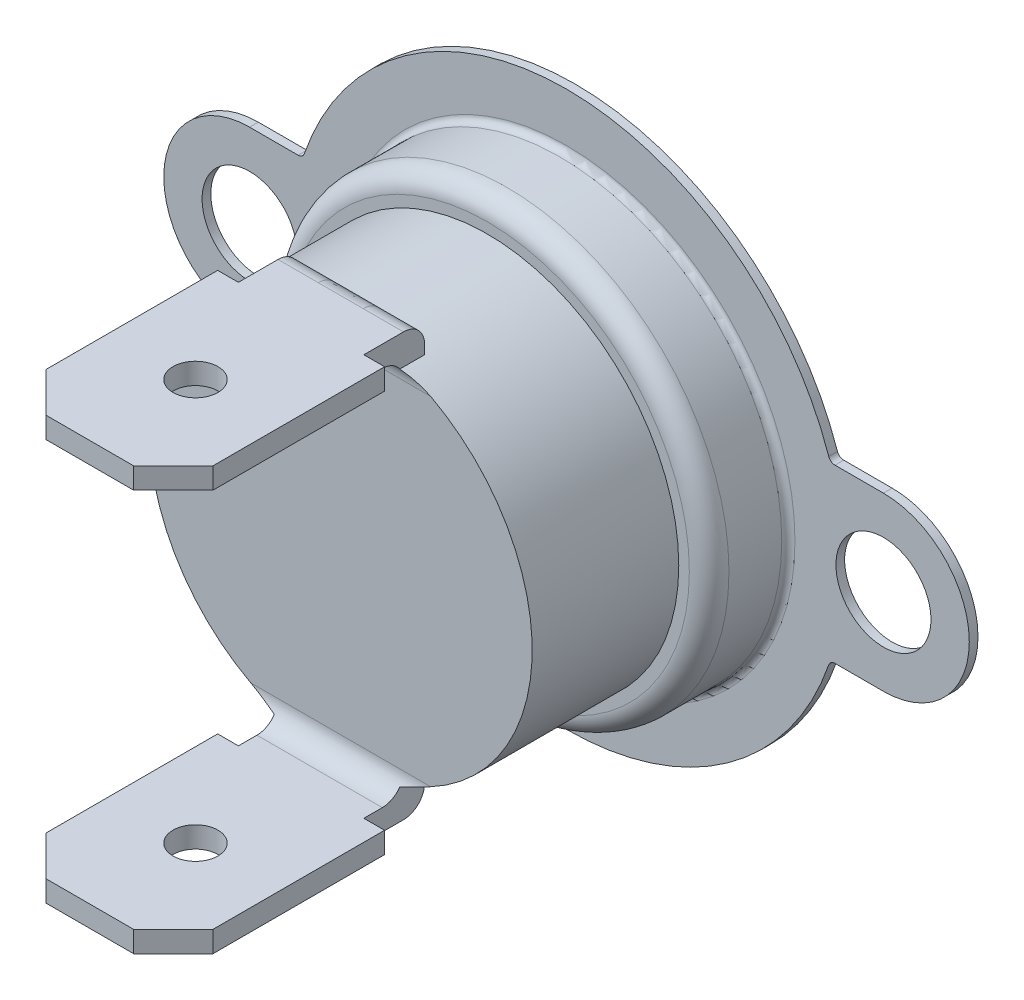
ISO-10303-21;
HEADER;
FILE_DESCRIPTION(('STEP AP214'),'2;1');
FILE_NAME('part.step','',(''),(''),'','','');
FILE_SCHEMA(('AUTOMOTIVE_DESIGN { 1 0 10303 214 1 1 1 1 }'));
ENDSEC;
DATA;
#1=APPLICATION_CONTEXT('core data for automotive mechanical design processes');
#2=APPLICATION_PROTOCOL_DEFINITION('international standard','automotive_design',2000,#1);
#3=PRODUCT_CONTEXT('',#1,'mechanical');
#4=PRODUCT('Part','Part','',(#3));
#5=PRODUCT_RELATED_PRODUCT_CATEGORY('part','',(#4));
#6=PRODUCT_DEFINITION_FORMATION('','',#4);
#7=PRODUCT_DEFINITION_CONTEXT('part definition',#1,'design');
#8=PRODUCT_DEFINITION('design','',#6,#7);
#9=PRODUCT_DEFINITION_SHAPE('','',#8);
#10=(LENGTH_UNIT() NAMED_UNIT(*) SI_UNIT(.MILLI.,.METRE.));
#11=(NAMED_UNIT(*) PLANE_ANGLE_UNIT() SI_UNIT($,.RADIAN.));
#12=(NAMED_UNIT(*) SI_UNIT($,.STERADIAN.) SOLID_ANGLE_UNIT());
#13=UNCERTAINTY_MEASURE_WITH_UNIT(LENGTH_MEASURE(1.E-05),#10,'distance_accuracy_value','');
#14=(GEOMETRIC_REPRESENTATION_CONTEXT(3) GLOBAL_UNCERTAINTY_ASSIGNED_CONTEXT((#13)) GLOBAL_UNIT_ASSIGNED_CONTEXT((#10,
#11,#12)) REPRESENTATION_CONTEXT('',''));
#15=CARTESIAN_POINT('',(0.,0.,0.));
#16=DIRECTION('',(0.,0.,1.));
#17=DIRECTION('',(1.,0.,0.));
#18=AXIS2_PLACEMENT_3D('',#15,#16,#17);
#19=CARTESIAN_POINT('',(2.375,-8.,8.08000000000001));
#20=DIRECTION('',(0.,0.,-1.));
#21=DIRECTION('',(-1.,0.,0.));
#22=AXIS2_PLACEMENT_3D('',#19,#20,#21);
#23=PLANE('',#22);
#24=DIRECTION('',(0.,1.,0.));
#25=VECTOR('',#24,1.);
#26=CARTESIAN_POINT('',(-2.375,-8.,8.08));
#27=LINE('',#26,#25);
#28=CARTESIAN_POINT('',(-2.375,6.84995437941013,8.08));
#29=VERTEX_POINT('',#28);
#30=CARTESIAN_POINT('',(-2.375,7.2,8.08));
#31=VERTEX_POINT('',#30);
#32=EDGE_CURVE('E772',#29,#31,#27,.T.);
#33=ORIENTED_EDGE('',*,*,#32,.T.);
#34=DIRECTION('',(-1.,0.,0.));
#35=VECTOR('',#34,1.);
#36=CARTESIAN_POINT('',(2.375,7.2,8.08000000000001));
#37=LINE('',#36,#35);
#38=CARTESIAN_POINT('',(-0.850000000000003,7.2,8.08));
#39=VERTEX_POINT('',#38);
#40=EDGE_CURVE('E790',#31,#39,#37,.F.);
#41=ORIENTED_EDGE('',*,*,#40,.T.);
#42=CARTESIAN_POINT('',(0.,0.,8.08000000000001));
#43=DIRECTION('',(0.,0.,-1.));
#44=DIRECTION('',(-1.,0.,0.));
#45=AXIS2_PLACEMENT_3D('',#42,#43,#44);
#46=CIRCLE('',#45,7.25);
#47=EDGE_CURVE('E478',#29,#39,#46,.T.);
#48=ORIENTED_EDGE('',*,*,#47,.F.);
#49=EDGE_LOOP('',(#33,#41,#48));
#50=FACE_BOUND('',#49,.T.);
#51=ADVANCED_FACE('F37',(#50),#23,.T.);
#52=DIRECTION('',(0.,1.,0.));
#53=VECTOR('',#52,1.);
#54=CARTESIAN_POINT('',(2.375,-8.,8.08000000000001));
#55=LINE('',#54,#53);
#56=CARTESIAN_POINT('',(2.375,-7.2,8.08000000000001));
#57=VERTEX_POINT('',#56);
#58=CARTESIAN_POINT('',(2.375,-6.84995437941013,8.08000000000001));
#59=VERTEX_POINT('',#58);
#60=EDGE_CURVE('E773',#57,#59,#55,.T.);
#61=ORIENTED_EDGE('',*,*,#60,.F.);
#62=DIRECTION('',(-1.,0.,0.));
#63=VECTOR('',#62,1.);
#64=CARTESIAN_POINT('',(-2.375,-7.2,8.08));
#65=LINE('',#64,#63);
#66=CARTESIAN_POINT('',(0.850000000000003,-7.2,8.08000000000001));
#67=VERTEX_POINT('',#66);
#68=EDGE_CURVE('E498',#57,#67,#65,.T.);
#69=ORIENTED_EDGE('',*,*,#68,.T.);
#70=EDGE_CURVE('E487',#59,#67,#46,.T.);
#71=ORIENTED_EDGE('',*,*,#70,.F.);
#72=EDGE_LOOP('',(#61,#69,#71));
#73=FACE_BOUND('',#72,.T.);
#74=ADVANCED_FACE('F443',(#73),#23,.T.);
#75=CARTESIAN_POINT('',(0.,0.,8.88));
#76=DIRECTION('',(0.,0.,1.));
#77=DIRECTION('',(1.,0.,0.));
#78=AXIS2_PLACEMENT_3D('',#75,#76,#77);
#79=PLANE('',#78);
#80=CARTESIAN_POINT('',(0.,0.,8.88));
#81=DIRECTION('',(0.,0.,1.));
#82=DIRECTION('',(1.,0.,0.));
#83=AXIS2_PLACEMENT_3D('',#80,#81,#82);
#84=CIRCLE('',#83,7.25);
#85=CARTESIAN_POINT('',(-3.40624426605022,6.4,8.88));
#86=VERTEX_POINT('',#85);
#87=CARTESIAN_POINT('',(-3.40624426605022,-6.4,8.88));
#88=VERTEX_POINT('',#87);
#89=EDGE_CURVE('E621',#86,#88,#84,.T.);
#90=ORIENTED_EDGE('',*,*,#89,.T.);
#91=DIRECTION('',(-1.,0.,0.));
#92=VECTOR('',#91,1.);
#93=CARTESIAN_POINT('',(0.,-6.4,8.88));
#94=LINE('',#93,#92);
#95=CARTESIAN_POINT('',(3.40624426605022,-6.4,8.88));
#96=VERTEX_POINT('',#95);
#97=EDGE_CURVE('E499',#88,#96,#94,.F.);
#98=ORIENTED_EDGE('',*,*,#97,.T.);
#99=CARTESIAN_POINT('',(3.40624426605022,6.4,8.88));
#100=VERTEX_POINT('',#99);
#101=EDGE_CURVE('E617',#96,#100,#84,.T.);
#102=ORIENTED_EDGE('',*,*,#101,.T.);
#103=DIRECTION('',(1.,0.,0.));
#104=VECTOR('',#103,1.);
#105=CARTESIAN_POINT('',(0.,6.4,8.88));
#106=LINE('',#105,#104);
#107=EDGE_CURVE('E804',#100,#86,#106,.F.);
#108=ORIENTED_EDGE('',*,*,#107,.T.);
#109=EDGE_LOOP('',(#90,#98,#102,#108));
#110=FACE_BOUND('',#109,.T.);
#111=ADVANCED_FACE('F449',(#110),#79,.T.);
#112=CARTESIAN_POINT('',(0.,0.,3.33));
#113=DIRECTION('',(0.,0.,1.));
#114=DIRECTION('',(1.,0.,0.));
#115=AXIS2_PLACEMENT_3D('',#112,#113,#114);
#116=PLANE('',#115);
#117=CARTESIAN_POINT('',(0.,0.,3.33));
#118=DIRECTION('',(0.,0.,1.));
#119=DIRECTION('',(1.,0.,0.));
#120=AXIS2_PLACEMENT_3D('',#117,#118,#119);
#121=CIRCLE('',#120,7.65);
#122=CARTESIAN_POINT('',(7.65,0.,3.33));
#123=VERTEX_POINT('',#122);
#124=EDGE_CURVE('E739',#123,#123,#121,.T.);
#125=ORIENTED_EDGE('',*,*,#124,.T.);
#126=EDGE_LOOP('',(#125));
#127=FACE_BOUND('',#126,.T.);
#128=CARTESIAN_POINT('',(0.,0.,3.33));
#129=DIRECTION('',(0.,0.,1.));
#130=DIRECTION('',(1.,0.,0.));
#131=AXIS2_PLACEMENT_3D('',#128,#129,#130);
#132=CIRCLE('',#131,7.25);
#133=CARTESIAN_POINT('',(7.25,0.,3.33));
#134=VERTEX_POINT('',#133);
#135=EDGE_CURVE('E622',#134,#134,#132,.T.);
#136=ORIENTED_EDGE('',*,*,#135,.F.);
#137=EDGE_LOOP('',(#136));
#138=FACE_BOUND('',#137,.T.);
#139=ADVANCED_FACE('F575',(#127,#138),#116,.T.);
#140=CARTESIAN_POINT('',(-12.,0.,0.33));
#141=DIRECTION('',(0.,0.,1.));
#142=DIRECTION('',(1.,0.,0.));
#143=AXIS2_PLACEMENT_3D('',#140,#141,#142);
#144=PLANE('',#143);
#145=CARTESIAN_POINT('',(0.,0.,0.33));
#146=DIRECTION('',(0.,0.,1.));
#147=DIRECTION('',(1.,0.,0.));
#148=AXIS2_PLACEMENT_3D('',#145,#146,#147);
#149=CIRCLE('',#148,8.65);
#150=CARTESIAN_POINT('',(8.65,0.,0.33));
#151=VERTEX_POINT('',#150);
#152=EDGE_CURVE('E736',#151,#151,#149,.F.);
#153=ORIENTED_EDGE('',*,*,#152,.T.);
#154=EDGE_LOOP('',(#153));
#155=FACE_BOUND('',#154,.T.);
#156=CARTESIAN_POINT('',(12.,0.,0.33));
#157=DIRECTION('',(0.,0.,1.));
#158=DIRECTION('',(1.,0.,0.));
#159=AXIS2_PLACEMENT_3D('',#156,#157,#158);
#160=CIRCLE('',#159,1.8);
#161=CARTESIAN_POINT('',(13.8,0.,0.33));
#162=VERTEX_POINT('',#161);
#163=EDGE_CURVE('E632',#162,#162,#160,.T.);
#164=ORIENTED_EDGE('',*,*,#163,.F.);
#165=EDGE_LOOP('',(#164));
#166=FACE_BOUND('',#165,.T.);
#167=CARTESIAN_POINT('',(-12.,0.,0.33));
#168=DIRECTION('',(0.,0.,1.));
#169=DIRECTION('',(1.,0.,0.));
#170=AXIS2_PLACEMENT_3D('',#167,#168,#169);
#171=CIRCLE('',#170,3.25000000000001);
#172=CARTESIAN_POINT('',(-12.,3.25000000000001,0.33));
#173=VERTEX_POINT('',#172);
#174=CARTESIAN_POINT('',(-12.,-3.25000000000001,0.33));
#175=VERTEX_POINT('',#174);
#176=EDGE_CURVE('E644',#173,#175,#171,.T.);
#177=ORIENTED_EDGE('',*,*,#176,.T.);
#178=DIRECTION('',(1.,0.,0.));
#179=VECTOR('',#178,1.);
#180=CARTESIAN_POINT('',(-12.,-3.25000000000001,0.33));
#181=LINE('',#180,#179);
#182=CARTESIAN_POINT('',(-10.1642756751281,-3.25000000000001,0.33));
#183=VERTEX_POINT('',#182);
#184=EDGE_CURVE('E647',#175,#183,#181,.T.);
#185=ORIENTED_EDGE('',*,*,#184,.T.);
#186=CARTESIAN_POINT('',(-10.1642756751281,-3.50000000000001,0.33));
#187=DIRECTION('',(0.,0.,1.));
#188=DIRECTION('',(1.,0.,0.));
#189=AXIS2_PLACEMENT_3D('',#186,#187,#188);
#190=CIRCLE('',#189,0.25);
#191=CARTESIAN_POINT('',(-9.92789717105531,-3.4186046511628,0.33));
#192=VERTEX_POINT('',#191);
#193=EDGE_CURVE('E727',#183,#192,#190,.F.);
#194=ORIENTED_EDGE('',*,*,#193,.T.);
#195=CARTESIAN_POINT('',(0.,0.,0.33));
#196=DIRECTION('',(0.,0.,1.));
#197=DIRECTION('',(1.,0.,0.));
#198=AXIS2_PLACEMENT_3D('',#195,#196,#197);
#199=CIRCLE('',#198,10.5);
#200=CARTESIAN_POINT('',(9.92789717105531,-3.4186046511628,0.33));
#201=VERTEX_POINT('',#200);
#202=EDGE_CURVE('E651',#192,#201,#199,.T.);
#203=ORIENTED_EDGE('',*,*,#202,.T.);
#204=CARTESIAN_POINT('',(10.1642756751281,-3.50000000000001,0.33));
#205=DIRECTION('',(0.,0.,1.));
#206=DIRECTION('',(1.,0.,0.));
#207=AXIS2_PLACEMENT_3D('',#204,#205,#206);
#208=CIRCLE('',#207,0.25);
#209=CARTESIAN_POINT('',(10.1642756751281,-3.25000000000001,0.33));
#210=VERTEX_POINT('',#209);
#211=EDGE_CURVE('E723',#201,#210,#208,.F.);
#212=ORIENTED_EDGE('',*,*,#211,.T.);
#213=DIRECTION('',(1.,0.,0.));
#214=VECTOR('',#213,1.);
#215=CARTESIAN_POINT('',(12.,-3.25000000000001,0.33));
#216=LINE('',#215,#214);
#217=CARTESIAN_POINT('',(12.,-3.25000000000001,0.33));
#218=VERTEX_POINT('',#217);
#219=EDGE_CURVE('E654',#210,#218,#216,.T.);
#220=ORIENTED_EDGE('',*,*,#219,.T.);
#221=CARTESIAN_POINT('',(12.,0.,0.33));
#222=DIRECTION('',(0.,0.,1.));
#223=DIRECTION('',(1.,0.,0.));
#224=AXIS2_PLACEMENT_3D('',#221,#222,#223);
#225=CIRCLE('',#224,3.25000000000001);
#226=CARTESIAN_POINT('',(12.,3.25000000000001,0.33));
#227=VERTEX_POINT('',#226);
#228=EDGE_CURVE('E656',#218,#227,#225,.T.);
#229=ORIENTED_EDGE('',*,*,#228,.T.);
#230=DIRECTION('',(-1.,0.,0.));
#231=VECTOR('',#230,1.);
#232=CARTESIAN_POINT('',(12.,3.25000000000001,0.33));
#233=LINE('',#232,#231);
#234=CARTESIAN_POINT('',(10.1642756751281,3.25000000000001,0.33));
#235=VERTEX_POINT('',#234);
#236=EDGE_CURVE('E658',#227,#235,#233,.T.);
#237=ORIENTED_EDGE('',*,*,#236,.T.);
#238=CARTESIAN_POINT('',(10.1642756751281,3.50000000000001,0.33));
#239=DIRECTION('',(0.,0.,1.));
#240=DIRECTION('',(1.,0.,0.));
#241=AXIS2_PLACEMENT_3D('',#238,#239,#240);
#242=CIRCLE('',#241,0.25);
#243=CARTESIAN_POINT('',(9.92789717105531,3.4186046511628,0.33));
#244=VERTEX_POINT('',#243);
#245=EDGE_CURVE('E719',#235,#244,#242,.F.);
#246=ORIENTED_EDGE('',*,*,#245,.T.);
#247=CARTESIAN_POINT('',(0.,0.,0.33));
#248=DIRECTION('',(0.,0.,1.));
#249=DIRECTION('',(1.,0.,0.));
#250=AXIS2_PLACEMENT_3D('',#247,#248,#249);
#251=CIRCLE('',#250,10.5);
#252=CARTESIAN_POINT('',(-9.92789717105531,3.4186046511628,0.33));
#253=VERTEX_POINT('',#252);
#254=EDGE_CURVE('E661',#244,#253,#251,.T.);
#255=ORIENTED_EDGE('',*,*,#254,.T.);
#256=CARTESIAN_POINT('',(-10.1642756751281,3.50000000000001,0.33));
#257=DIRECTION('',(0.,0.,1.));
#258=DIRECTION('',(1.,0.,0.));
#259=AXIS2_PLACEMENT_3D('',#256,#257,#258);
#260=CIRCLE('',#259,0.25);
#261=CARTESIAN_POINT('',(-10.1642756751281,3.25000000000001,0.33));
#262=VERTEX_POINT('',#261);
#263=EDGE_CURVE('E731',#253,#262,#260,.F.);
#264=ORIENTED_EDGE('',*,*,#263,.T.);
#265=DIRECTION('',(-1.,0.,0.));
#266=VECTOR('',#265,1.);
#267=CARTESIAN_POINT('',(-12.,3.25000000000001,0.33));
#268=LINE('',#267,#266);
#269=EDGE_CURVE('E664',#262,#173,#268,.T.);
#270=ORIENTED_EDGE('',*,*,#269,.T.);
#271=EDGE_LOOP('',(#177,#185,#194,#203,#212,#220,#229,#237,#246,#255,#264,#270));
#272=FACE_BOUND('',#271,.T.);
#273=CARTESIAN_POINT('',(-12.,0.,0.33));
#274=DIRECTION('',(0.,0.,1.));
#275=DIRECTION('',(1.,0.,0.));
#276=AXIS2_PLACEMENT_3D('',#273,#274,#275);
#277=CIRCLE('',#276,1.8);
#278=CARTESIAN_POINT('',(-10.2,0.,0.33));
#279=VERTEX_POINT('',#278);
#280=EDGE_CURVE('E638',#279,#279,#277,.T.);
#281=ORIENTED_EDGE('',*,*,#280,.F.);
#282=EDGE_LOOP('',(#281));
#283=FACE_BOUND('',#282,.T.);
#284=ADVANCED_FACE('F1259',(#155,#166,#272,#283),#144,.T.);
#285=CARTESIAN_POINT('',(-12.,0.,0.));
#286=DIRECTION('',(0.,0.,1.));
#287=DIRECTION('',(1.,0.,0.));
#288=AXIS2_PLACEMENT_3D('',#285,#286,#287);
#289=PLANE('',#288);
#290=CARTESIAN_POINT('',(-12.,0.,0.));
#291=DIRECTION('',(0.,0.,1.));
#292=DIRECTION('',(1.,0.,0.));
#293=AXIS2_PLACEMENT_3D('',#290,#291,#292);
#294=CIRCLE('',#293,1.8);
#295=CARTESIAN_POINT('',(-10.2,0.,0.));
#296=VERTEX_POINT('',#295);
#297=EDGE_CURVE('E635',#296,#296,#294,.T.);
#298=ORIENTED_EDGE('',*,*,#297,.T.);
#299=EDGE_LOOP('',(#298));
#300=FACE_BOUND('',#299,.T.);
#301=CARTESIAN_POINT('',(-12.,0.,0.));
#302=DIRECTION('',(0.,0.,1.));
#303=DIRECTION('',(1.,0.,0.));
#304=AXIS2_PLACEMENT_3D('',#301,#302,#303);
#305=CIRCLE('',#304,3.25000000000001);
#306=CARTESIAN_POINT('',(-12.,3.25000000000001,0.));
#307=VERTEX_POINT('',#306);
#308=CARTESIAN_POINT('',(-12.,-3.25000000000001,0.));
#309=VERTEX_POINT('',#308);
#310=EDGE_CURVE('E641',#307,#309,#305,.T.);
#311=ORIENTED_EDGE('',*,*,#310,.F.);
#312=DIRECTION('',(-1.,0.,0.));
#313=VECTOR('',#312,1.);
#314=CARTESIAN_POINT('',(-12.,3.25000000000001,0.));
#315=LINE('',#314,#313);
#316=CARTESIAN_POINT('',(-10.1642756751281,3.25000000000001,0.));
#317=VERTEX_POINT('',#316);
#318=EDGE_CURVE('E648',#317,#307,#315,.T.);
#319=ORIENTED_EDGE('',*,*,#318,.F.);
#320=CARTESIAN_POINT('',(-10.1642756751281,3.50000000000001,0.));
#321=DIRECTION('',(0.,0.,1.));
#322=DIRECTION('',(1.,0.,0.));
#323=AXIS2_PLACEMENT_3D('',#320,#321,#322);
#324=CIRCLE('',#323,0.25);
#325=CARTESIAN_POINT('',(-9.92789717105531,3.4186046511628,0.));
#326=VERTEX_POINT('',#325);
#327=EDGE_CURVE('E729',#317,#326,#324,.T.);
#328=ORIENTED_EDGE('',*,*,#327,.T.);
#329=CARTESIAN_POINT('',(0.,0.,0.));
#330=DIRECTION('',(0.,0.,1.));
#331=DIRECTION('',(1.,0.,0.));
#332=AXIS2_PLACEMENT_3D('',#329,#330,#331);
#333=CIRCLE('',#332,10.5);
#334=CARTESIAN_POINT('',(9.92789717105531,3.4186046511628,0.));
#335=VERTEX_POINT('',#334);
#336=EDGE_CURVE('E682',#335,#326,#333,.T.);
#337=ORIENTED_EDGE('',*,*,#336,.F.);
#338=CARTESIAN_POINT('',(10.1642756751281,3.50000000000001,0.));
#339=DIRECTION('',(0.,0.,1.));
#340=DIRECTION('',(1.,0.,0.));
#341=AXIS2_PLACEMENT_3D('',#338,#339,#340);
#342=CIRCLE('',#341,0.25);
#343=CARTESIAN_POINT('',(10.1642756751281,3.25000000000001,0.));
#344=VERTEX_POINT('',#343);
#345=EDGE_CURVE('E717',#335,#344,#342,.T.);
#346=ORIENTED_EDGE('',*,*,#345,.T.);
#347=DIRECTION('',(-1.,0.,0.));
#348=VECTOR('',#347,1.);
#349=CARTESIAN_POINT('',(12.,3.25000000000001,0.));
#350=LINE('',#349,#348);
#351=CARTESIAN_POINT('',(12.,3.25000000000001,0.));
#352=VERTEX_POINT('',#351);
#353=EDGE_CURVE('E679',#352,#344,#350,.T.);
#354=ORIENTED_EDGE('',*,*,#353,.F.);
#355=CARTESIAN_POINT('',(12.,0.,0.));
#356=DIRECTION('',(0.,0.,1.));
#357=DIRECTION('',(1.,0.,0.));
#358=AXIS2_PLACEMENT_3D('',#355,#356,#357);
#359=CIRCLE('',#358,3.25000000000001);
#360=CARTESIAN_POINT('',(12.,-3.25000000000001,0.));
#361=VERTEX_POINT('',#360);
#362=EDGE_CURVE('E677',#361,#352,#359,.T.);
#363=ORIENTED_EDGE('',*,*,#362,.F.);
#364=DIRECTION('',(1.,0.,0.));
#365=VECTOR('',#364,1.);
#366=CARTESIAN_POINT('',(12.,-3.25000000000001,0.));
#367=LINE('',#366,#365);
#368=CARTESIAN_POINT('',(10.1642756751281,-3.25000000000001,0.));
#369=VERTEX_POINT('',#368);
#370=EDGE_CURVE('E675',#369,#361,#367,.T.);
#371=ORIENTED_EDGE('',*,*,#370,.F.);
#372=CARTESIAN_POINT('',(10.1642756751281,-3.50000000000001,0.));
#373=DIRECTION('',(0.,0.,1.));
#374=DIRECTION('',(1.,0.,0.));
#375=AXIS2_PLACEMENT_3D('',#372,#373,#374);
#376=CIRCLE('',#375,0.25);
#377=CARTESIAN_POINT('',(9.92789717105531,-3.4186046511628,0.));
#378=VERTEX_POINT('',#377);
#379=EDGE_CURVE('E721',#369,#378,#376,.T.);
#380=ORIENTED_EDGE('',*,*,#379,.T.);
#381=CARTESIAN_POINT('',(0.,0.,0.));
#382=DIRECTION('',(0.,0.,1.));
#383=DIRECTION('',(1.,0.,0.));
#384=AXIS2_PLACEMENT_3D('',#381,#382,#383);
#385=CIRCLE('',#384,10.5);
#386=CARTESIAN_POINT('',(-9.92789717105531,-3.4186046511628,0.));
#387=VERTEX_POINT('',#386);
#388=EDGE_CURVE('E672',#387,#378,#385,.T.);
#389=ORIENTED_EDGE('',*,*,#388,.F.);
#390=CARTESIAN_POINT('',(-10.1642756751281,-3.50000000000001,0.));
#391=DIRECTION('',(0.,0.,1.));
#392=DIRECTION('',(1.,0.,0.));
#393=AXIS2_PLACEMENT_3D('',#390,#391,#392);
#394=CIRCLE('',#393,0.25);
#395=CARTESIAN_POINT('',(-10.1642756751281,-3.25000000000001,0.));
#396=VERTEX_POINT('',#395);
#397=EDGE_CURVE('E725',#387,#396,#394,.T.);
#398=ORIENTED_EDGE('',*,*,#397,.T.);
#399=DIRECTION('',(1.,0.,0.));
#400=VECTOR('',#399,1.);
#401=CARTESIAN_POINT('',(-12.,-3.25000000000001,0.));
#402=LINE('',#401,#400);
#403=EDGE_CURVE('E669',#309,#396,#402,.T.);
#404=ORIENTED_EDGE('',*,*,#403,.F.);
#405=EDGE_LOOP('',(#311,#319,#328,#337,#346,#354,#363,#371,#380,#389,#398,#404));
#406=FACE_BOUND('',#405,.T.);
#407=CARTESIAN_POINT('',(12.,0.,0.));
#408=DIRECTION('',(0.,0.,1.));
#409=DIRECTION('',(1.,0.,0.));
#410=AXIS2_PLACEMENT_3D('',#407,#408,#409);
#411=CIRCLE('',#410,1.8);
#412=CARTESIAN_POINT('',(13.8,0.,0.));
#413=VERTEX_POINT('',#412);
#414=EDGE_CURVE('E625',#413,#413,#411,.T.);
#415=ORIENTED_EDGE('',*,*,#414,.T.);
#416=EDGE_LOOP('',(#415));
#417=FACE_BOUND('',#416,.T.);
#418=ADVANCED_FACE('F1267',(#300,#406,#417),#289,.F.);
#419=CARTESIAN_POINT('',(-12.,0.,0.33));
#420=DIRECTION('',(0.,0.,-1.));
#421=DIRECTION('',(-1.,0.,0.));
#422=AXIS2_PLACEMENT_3D('',#419,#420,#421);
#423=CYLINDRICAL_SURFACE('',#422,3.25000000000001);
#424=ORIENTED_EDGE('',*,*,#310,.T.);
#425=DIRECTION('',(0.,0.,-1.));
#426=VECTOR('',#425,1.);
#427=CARTESIAN_POINT('',(-12.,-3.25000000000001,0.33));
#428=LINE('',#427,#426);
#429=EDGE_CURVE('E694',#175,#309,#428,.T.);
#430=ORIENTED_EDGE('',*,*,#429,.F.);
#431=ORIENTED_EDGE('',*,*,#176,.F.);
#432=DIRECTION('',(0.,0.,-1.));
#433=VECTOR('',#432,1.);
#434=CARTESIAN_POINT('',(-12.,3.25000000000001,0.33));
#435=LINE('',#434,#433);
#436=EDGE_CURVE('E666',#173,#307,#435,.T.);
#437=ORIENTED_EDGE('',*,*,#436,.T.);
#438=EDGE_LOOP('',(#424,#430,#431,#437));
#439=FACE_BOUND('',#438,.T.);
#440=ADVANCED_FACE('F1276',(#439),#423,.T.);
#441=CARTESIAN_POINT('',(-12.,-3.25000000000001,0.33));
#442=DIRECTION('',(0.,1.,0.));
#443=DIRECTION('',(0.,0.,1.));
#444=AXIS2_PLACEMENT_3D('',#441,#442,#443);
#445=PLANE('',#444);
#446=ORIENTED_EDGE('',*,*,#403,.T.);
#447=DIRECTION('',(0.,0.,1.));
#448=VECTOR('',#447,1.);
#449=CARTESIAN_POINT('',(-10.1642756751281,-3.25000000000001,0.33));
#450=LINE('',#449,#448);
#451=EDGE_CURVE('E712',#396,#183,#450,.T.);
#452=ORIENTED_EDGE('',*,*,#451,.T.);
#453=ORIENTED_EDGE('',*,*,#184,.F.);
#454=ORIENTED_EDGE('',*,*,#429,.T.);
#455=EDGE_LOOP('',(#446,#452,#453,#454));
#456=FACE_BOUND('',#455,.T.);
#457=ADVANCED_FACE('F1286',(#456),#445,.F.);
#458=CARTESIAN_POINT('',(0.,0.,0.33));
#459=DIRECTION('',(0.,0.,-1.));
#460=DIRECTION('',(-1.,0.,0.));
#461=AXIS2_PLACEMENT_3D('',#458,#459,#460);
#462=CYLINDRICAL_SURFACE('',#461,10.5);
#463=ORIENTED_EDGE('',*,*,#388,.T.);
#464=DIRECTION('',(0.,0.,-1.));
#465=VECTOR('',#464,1.);
#466=CARTESIAN_POINT('',(9.92789717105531,-3.4186046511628,0.33));
#467=LINE('',#466,#465);
#468=EDGE_CURVE('E710',#378,#201,#467,.F.);
#469=ORIENTED_EDGE('',*,*,#468,.T.);
#470=ORIENTED_EDGE('',*,*,#202,.F.);
#471=DIRECTION('',(0.,0.,-1.));
#472=VECTOR('',#471,1.);
#473=CARTESIAN_POINT('',(-9.92789717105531,-3.4186046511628,0.33));
#474=LINE('',#473,#472);
#475=EDGE_CURVE('E707',#192,#387,#474,.T.);
#476=ORIENTED_EDGE('',*,*,#475,.T.);
#477=EDGE_LOOP('',(#463,#469,#470,#476));
#478=FACE_BOUND('',#477,.T.);
#479=ADVANCED_FACE('F1294',(#478),#462,.T.);
#480=CARTESIAN_POINT('',(12.,-3.25000000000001,0.33));
#481=DIRECTION('',(0.,1.,0.));
#482=DIRECTION('',(0.,0.,1.));
#483=AXIS2_PLACEMENT_3D('',#480,#481,#482);
#484=PLANE('',#483);
#485=ORIENTED_EDGE('',*,*,#219,.F.);
#486=DIRECTION('',(0.,0.,1.));
#487=VECTOR('',#486,1.);
#488=CARTESIAN_POINT('',(10.1642756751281,-3.25000000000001,0.));
#489=LINE('',#488,#487);
#490=EDGE_CURVE('E704',#210,#369,#489,.F.);
#491=ORIENTED_EDGE('',*,*,#490,.T.);
#492=ORIENTED_EDGE('',*,*,#370,.T.);
#493=DIRECTION('',(0.,0.,-1.));
#494=VECTOR('',#493,1.);
#495=CARTESIAN_POINT('',(12.,-3.25000000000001,0.33));
#496=LINE('',#495,#494);
#497=EDGE_CURVE('E691',#218,#361,#496,.T.);
#498=ORIENTED_EDGE('',*,*,#497,.F.);
#499=EDGE_LOOP('',(#485,#491,#492,#498));
#500=FACE_BOUND('',#499,.T.);
#501=ADVANCED_FACE('F1302',(#500),#484,.F.);
#502=CARTESIAN_POINT('',(12.,0.,0.33));
#503=DIRECTION('',(0.,0.,-1.));
#504=DIRECTION('',(-1.,0.,0.));
#505=AXIS2_PLACEMENT_3D('',#502,#503,#504);
#506=CYLINDRICAL_SURFACE('',#505,3.25000000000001);
#507=ORIENTED_EDGE('',*,*,#362,.T.);
#508=DIRECTION('',(0.,0.,-1.));
#509=VECTOR('',#508,1.);
#510=CARTESIAN_POINT('',(12.,3.25000000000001,0.33));
#511=LINE('',#510,#509);
#512=EDGE_CURVE('E688',#227,#352,#511,.T.);
#513=ORIENTED_EDGE('',*,*,#512,.F.);
#514=ORIENTED_EDGE('',*,*,#228,.F.);
#515=ORIENTED_EDGE('',*,*,#497,.T.);
#516=EDGE_LOOP('',(#507,#513,#514,#515));
#517=FACE_BOUND('',#516,.T.);
#518=ADVANCED_FACE('F1310',(#517),#506,.T.);
#519=CARTESIAN_POINT('',(12.,3.25000000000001,0.33));
#520=DIRECTION('',(0.,-1.,0.));
#521=DIRECTION('',(0.,0.,-1.));
#522=AXIS2_PLACEMENT_3D('',#519,#520,#521);
#523=PLANE('',#522);
#524=ORIENTED_EDGE('',*,*,#353,.T.);
#525=DIRECTION('',(0.,0.,1.));
#526=VECTOR('',#525,1.);
#527=CARTESIAN_POINT('',(10.1642756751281,3.25000000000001,0.33));
#528=LINE('',#527,#526);
#529=EDGE_CURVE('E702',#344,#235,#528,.T.);
#530=ORIENTED_EDGE('',*,*,#529,.T.);
#531=ORIENTED_EDGE('',*,*,#236,.F.);
#532=ORIENTED_EDGE('',*,*,#512,.T.);
#533=EDGE_LOOP('',(#524,#530,#531,#532));
#534=FACE_BOUND('',#533,.T.);
#535=ADVANCED_FACE('F1318',(#534),#523,.F.);
#536=CARTESIAN_POINT('',(0.,0.,0.33));
#537=DIRECTION('',(0.,0.,-1.));
#538=DIRECTION('',(-1.,0.,0.));
#539=AXIS2_PLACEMENT_3D('',#536,#537,#538);
#540=CYLINDRICAL_SURFACE('',#539,10.5);
#541=ORIENTED_EDGE('',*,*,#254,.F.);
#542=DIRECTION('',(0.,0.,-1.));
#543=VECTOR('',#542,1.);
#544=CARTESIAN_POINT('',(9.92789717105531,3.4186046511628,0.33));
#545=LINE('',#544,#543);
#546=EDGE_CURVE('E699',#244,#335,#545,.T.);
#547=ORIENTED_EDGE('',*,*,#546,.T.);
#548=ORIENTED_EDGE('',*,*,#336,.T.);
#549=DIRECTION('',(0.,0.,-1.));
#550=VECTOR('',#549,1.);
#551=CARTESIAN_POINT('',(-9.92789717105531,3.4186046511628,0.33));
#552=LINE('',#551,#550);
#553=EDGE_CURVE('E697',#326,#253,#552,.F.);
#554=ORIENTED_EDGE('',*,*,#553,.T.);
#555=EDGE_LOOP('',(#541,#547,#548,#554));
#556=FACE_BOUND('',#555,.T.);
#557=ADVANCED_FACE('F1326',(#556),#540,.T.);
#558=CARTESIAN_POINT('',(-12.,3.25000000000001,0.33));
#559=DIRECTION('',(0.,-1.,0.));
#560=DIRECTION('',(0.,0.,-1.));
#561=AXIS2_PLACEMENT_3D('',#558,#559,#560);
#562=PLANE('',#561);
#563=ORIENTED_EDGE('',*,*,#269,.F.);
#564=DIRECTION('',(0.,0.,1.));
#565=VECTOR('',#564,1.);
#566=CARTESIAN_POINT('',(-10.1642756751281,3.25000000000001,0.));
#567=LINE('',#566,#565);
#568=EDGE_CURVE('E714',#262,#317,#567,.F.);
#569=ORIENTED_EDGE('',*,*,#568,.T.);
#570=ORIENTED_EDGE('',*,*,#318,.T.);
#571=ORIENTED_EDGE('',*,*,#436,.F.);
#572=EDGE_LOOP('',(#563,#569,#570,#571));
#573=FACE_BOUND('',#572,.T.);
#574=ADVANCED_FACE('F1334',(#573),#562,.F.);
#575=CARTESIAN_POINT('',(-12.,0.,0.33));
#576=DIRECTION('',(0.,0.,-1.));
#577=DIRECTION('',(-1.,0.,0.));
#578=AXIS2_PLACEMENT_3D('',#575,#576,#577);
#579=CYLINDRICAL_SURFACE('',#578,1.8);
#580=ORIENTED_EDGE('',*,*,#280,.T.);
#581=EDGE_LOOP('',(#580));
#582=FACE_BOUND('',#581,.T.);
#583=ORIENTED_EDGE('',*,*,#297,.F.);
#584=EDGE_LOOP('',(#583));
#585=FACE_BOUND('',#584,.T.);
#586=ADVANCED_FACE('F1342',(#582,#585),#579,.F.);
#587=CARTESIAN_POINT('',(12.,0.,0.33));
#588=DIRECTION('',(0.,0.,-1.));
#589=DIRECTION('',(-1.,0.,0.));
#590=AXIS2_PLACEMENT_3D('',#587,#588,#589);
#591=CYLINDRICAL_SURFACE('',#590,1.8);
#592=ORIENTED_EDGE('',*,*,#163,.T.);
#593=EDGE_LOOP('',(#592));
#594=FACE_BOUND('',#593,.T.);
#595=ORIENTED_EDGE('',*,*,#414,.F.);
#596=EDGE_LOOP('',(#595));
#597=FACE_BOUND('',#596,.T.);
#598=ADVANCED_FACE('F1350',(#594,#597),#591,.F.);
#599=CARTESIAN_POINT('',(10.1642756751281,3.50000000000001,0.33));
#600=DIRECTION('',(0.,0.,-1.));
#601=DIRECTION('',(-1.,0.,0.));
#602=AXIS2_PLACEMENT_3D('',#599,#600,#601);
#603=CYLINDRICAL_SURFACE('',#602,0.25);
#604=ORIENTED_EDGE('',*,*,#245,.F.);
#605=ORIENTED_EDGE('',*,*,#529,.F.);
#606=ORIENTED_EDGE('',*,*,#345,.F.);
#607=ORIENTED_EDGE('',*,*,#546,.F.);
#608=EDGE_LOOP('',(#604,#605,#606,#607));
#609=FACE_BOUND('',#608,.T.);
#610=ADVANCED_FACE('F1357',(#609),#603,.F.);
#611=CARTESIAN_POINT('',(10.1642756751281,-3.50000000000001,0.33));
#612=DIRECTION('',(0.,0.,-1.));
#613=DIRECTION('',(-1.,0.,0.));
#614=AXIS2_PLACEMENT_3D('',#611,#612,#613);
#615=CYLINDRICAL_SURFACE('',#614,0.25);
#616=ORIENTED_EDGE('',*,*,#211,.F.);
#617=ORIENTED_EDGE('',*,*,#468,.F.);
#618=ORIENTED_EDGE('',*,*,#379,.F.);
#619=ORIENTED_EDGE('',*,*,#490,.F.);
#620=EDGE_LOOP('',(#616,#617,#618,#619));
#621=FACE_BOUND('',#620,.T.);
#622=ADVANCED_FACE('F1364',(#621),#615,.F.);
#623=CARTESIAN_POINT('',(-10.1642756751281,-3.50000000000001,0.33));
#624=DIRECTION('',(0.,0.,-1.));
#625=DIRECTION('',(-1.,0.,0.));
#626=AXIS2_PLACEMENT_3D('',#623,#624,#625);
#627=CYLINDRICAL_SURFACE('',#626,0.25);
#628=ORIENTED_EDGE('',*,*,#193,.F.);
#629=ORIENTED_EDGE('',*,*,#451,.F.);
#630=ORIENTED_EDGE('',*,*,#397,.F.);
#631=ORIENTED_EDGE('',*,*,#475,.F.);
#632=EDGE_LOOP('',(#628,#629,#630,#631));
#633=FACE_BOUND('',#632,.T.);
#634=ADVANCED_FACE('F1372',(#633),#627,.F.);
#635=CARTESIAN_POINT('',(-10.1642756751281,3.50000000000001,0.33));
#636=DIRECTION('',(0.,0.,-1.));
#637=DIRECTION('',(-1.,0.,0.));
#638=AXIS2_PLACEMENT_3D('',#635,#636,#637);
#639=CYLINDRICAL_SURFACE('',#638,0.25);
#640=ORIENTED_EDGE('',*,*,#263,.F.);
#641=ORIENTED_EDGE('',*,*,#553,.F.);
#642=ORIENTED_EDGE('',*,*,#327,.F.);
#643=ORIENTED_EDGE('',*,*,#568,.F.);
#644=EDGE_LOOP('',(#640,#641,#642,#643));
#645=FACE_BOUND('',#644,.T.);
#646=ADVANCED_FACE('F1380',(#645),#639,.F.);
#647=CARTESIAN_POINT('',(0.,0.,3.33));
#648=DIRECTION('',(0.,0.,-1.));
#649=DIRECTION('',(-1.,0.,0.));
#650=AXIS2_PLACEMENT_3D('',#647,#648,#649);
#651=CYLINDRICAL_SURFACE('',#650,8.4);
#652=CARTESIAN_POINT('',(0.,0.,2.58));
#653=DIRECTION('',(0.,0.,1.));
#654=DIRECTION('',(1.,0.,0.));
#655=AXIS2_PLACEMENT_3D('',#652,#653,#654);
#656=CIRCLE('',#655,8.4);
#657=CARTESIAN_POINT('',(8.4,0.,2.58));
#658=VERTEX_POINT('',#657);
#659=EDGE_CURVE('E742',#658,#658,#656,.F.);
#660=ORIENTED_EDGE('',*,*,#659,.T.);
#661=EDGE_LOOP('',(#660));
#662=FACE_BOUND('',#661,.T.);
#663=CARTESIAN_POINT('',(0.,0.,0.58));
#664=DIRECTION('',(0.,0.,1.));
#665=DIRECTION('',(1.,0.,0.));
#666=AXIS2_PLACEMENT_3D('',#663,#664,#665);
#667=CIRCLE('',#666,8.4);
#668=CARTESIAN_POINT('',(8.4,0.,0.58));
#669=VERTEX_POINT('',#668);
#670=EDGE_CURVE('E733',#669,#669,#667,.T.);
#671=ORIENTED_EDGE('',*,*,#670,.T.);
#672=EDGE_LOOP('',(#671));
#673=FACE_BOUND('',#672,.T.);
#674=ADVANCED_FACE('F574',(#662,#673),#651,.T.);
#675=CARTESIAN_POINT('',(0.,0.,8.88));
#676=DIRECTION('',(0.,0.,-1.));
#677=DIRECTION('',(-1.,0.,0.));
#678=AXIS2_PLACEMENT_3D('',#675,#676,#677);
#679=CYLINDRICAL_SURFACE('',#678,7.25);
#680=ORIENTED_EDGE('',*,*,#70,.T.);
#681=CARTESIAN_POINT('',(-0.850000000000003,-7.2,8.08));
#682=VERTEX_POINT('',#681);
#683=EDGE_CURVE('E477',#67,#682,#46,.T.);
#684=ORIENTED_EDGE('',*,*,#683,.T.);
#685=CARTESIAN_POINT('',(-2.375,-6.84995437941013,8.08));
#686=VERTEX_POINT('',#685);
#687=EDGE_CURVE('E469',#682,#686,#46,.T.);
#688=ORIENTED_EDGE('',*,*,#687,.T.);
#689=DIRECTION('',(0.,0.,-1.));
#690=VECTOR('',#689,1.);
#691=CARTESIAN_POINT('',(-2.375,-6.84995437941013,8.88));
#692=LINE('',#691,#690);
#693=CARTESIAN_POINT('',(-2.375,-6.84995437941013,9.01853113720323));
#694=VERTEX_POINT('',#693);
#695=EDGE_CURVE('E777',#686,#694,#692,.F.);
#696=ORIENTED_EDGE('',*,*,#695,.T.);
#697=CARTESIAN_POINT('',(-2.375,-6.84995437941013,9.01853113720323));
#698=CARTESIAN_POINT('',(-2.46254621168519,-6.81960347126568,8.9979211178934));
#699=CARTESIAN_POINT('',(-2.54990486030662,-6.7874316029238,8.97905880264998));
#700=CARTESIAN_POINT('',(-2.7236279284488,-6.71959812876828,8.9456332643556));
#701=CARTESIAN_POINT('',(-2.80999502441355,-6.6839523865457,8.93105161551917));
#702=CARTESIAN_POINT('',(-2.98190734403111,-6.60904828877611,8.90679519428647));
#703=CARTESIAN_POINT('',(-3.06745234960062,-6.56978900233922,8.89712169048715));
#704=CARTESIAN_POINT('',(-3.19503288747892,-6.50818789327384,8.88707468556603));
#705=CARTESIAN_POINT('',(-3.23753057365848,-6.48715234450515,8.88446877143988));
#706=CARTESIAN_POINT('',(-3.32217055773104,-6.44421730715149,8.88093346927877));
#707=CARTESIAN_POINT('',(-3.36431275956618,-6.42231759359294,8.88000452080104));
#708=CARTESIAN_POINT('',(-3.40624426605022,-6.4,8.88));
#709=B_SPLINE_CURVE_WITH_KNOTS('',3,(#697,#698,#699,#700,#701,#702,#703,#704,#705,#706,#707,
#708),.UNSPECIFIED.,.F.,.F.,(4,2,2,2,2,4),(0.,0.284775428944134,0.568306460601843,
0.851910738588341,0.994347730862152,1.13682205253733),.UNSPECIFIED.);
#710=EDGE_CURVE('E587',#694,#88,#709,.T.);
#711=ORIENTED_EDGE('',*,*,#710,.T.);
#712=ORIENTED_EDGE('',*,*,#89,.F.);
#713=CARTESIAN_POINT('',(-3.40624426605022,6.4,8.88));
#714=CARTESIAN_POINT('',(-3.36431275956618,6.42231759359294,8.88000452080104));
#715=CARTESIAN_POINT('',(-3.32217055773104,6.44421730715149,8.88093346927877));
#716=CARTESIAN_POINT('',(-3.23753057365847,6.48715234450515,8.88446877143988));
#717=CARTESIAN_POINT('',(-3.19503288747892,6.50818789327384,8.88707468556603));
#718=CARTESIAN_POINT('',(-3.06745234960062,6.56978900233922,8.89712169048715));
#719=CARTESIAN_POINT('',(-2.98190734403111,6.60904828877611,8.90679519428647));
#720=CARTESIAN_POINT('',(-2.80999502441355,6.6839523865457,8.93105161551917));
#721=CARTESIAN_POINT('',(-2.7236279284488,6.71959812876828,8.9456332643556));
#722=CARTESIAN_POINT('',(-2.54990486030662,6.7874316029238,8.97905880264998));
#723=CARTESIAN_POINT('',(-2.46254621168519,6.81960347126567,8.9979211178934));
#724=CARTESIAN_POINT('',(-2.375,6.84995437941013,9.01853113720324));
#725=B_SPLINE_CURVE_WITH_KNOTS('',3,(#713,#714,#715,#716,#717,#718,#719,#720,#721,#722,#723,
#724),.UNSPECIFIED.,.F.,.F.,(4,2,2,2,2,4),(0.,0.142474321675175,0.284911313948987,
0.568515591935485,0.852046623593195,1.13682205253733),.UNSPECIFIED.);
#726=CARTESIAN_POINT('',(-2.375,6.84995437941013,9.01853113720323));
#727=VERTEX_POINT('',#726);
#728=EDGE_CURVE('E562',#86,#727,#725,.T.);
#729=ORIENTED_EDGE('',*,*,#728,.T.);
#730=DIRECTION('',(0.,0.,-1.));
#731=VECTOR('',#730,1.);
#732=CARTESIAN_POINT('',(-2.375,6.84995437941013,8.88));
#733=LINE('',#732,#731);
#734=EDGE_CURVE('E627',#727,#29,#733,.T.);
#735=ORIENTED_EDGE('',*,*,#734,.T.);
#736=ORIENTED_EDGE('',*,*,#47,.T.);
#737=CARTESIAN_POINT('',(0.850000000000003,7.2,8.08000000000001));
#738=VERTEX_POINT('',#737);
#739=EDGE_CURVE('E480',#39,#738,#46,.T.);
#740=ORIENTED_EDGE('',*,*,#739,.T.);
#741=CARTESIAN_POINT('',(2.375,6.84995437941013,8.08000000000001));
#742=VERTEX_POINT('',#741);
#743=EDGE_CURVE('E744',#738,#742,#46,.T.);
#744=ORIENTED_EDGE('',*,*,#743,.T.);
#745=DIRECTION('',(0.,0.,-1.));
#746=VECTOR('',#745,1.);
#747=CARTESIAN_POINT('',(2.375,6.84995437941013,8.88000000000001));
#748=LINE('',#747,#746);
#749=CARTESIAN_POINT('',(2.375,6.84995437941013,9.01853113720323));
#750=VERTEX_POINT('',#749);
#751=EDGE_CURVE('E771',#742,#750,#748,.F.);
#752=ORIENTED_EDGE('',*,*,#751,.T.);
#753=CARTESIAN_POINT('',(2.375,6.84995437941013,9.01853113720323));
#754=CARTESIAN_POINT('',(2.46254621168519,6.81960347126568,8.9979211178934));
#755=CARTESIAN_POINT('',(2.54990486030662,6.7874316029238,8.97905880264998));
#756=CARTESIAN_POINT('',(2.7236279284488,6.71959812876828,8.9456332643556));
#757=CARTESIAN_POINT('',(2.80999502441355,6.6839523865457,8.93105161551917));
#758=CARTESIAN_POINT('',(2.98190734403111,6.60904828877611,8.90679519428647));
#759=CARTESIAN_POINT('',(3.06745234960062,6.56978900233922,8.89712169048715));
#760=CARTESIAN_POINT('',(3.19503288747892,6.50818789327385,8.88707468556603));
#761=CARTESIAN_POINT('',(3.23753057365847,6.48715234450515,8.88446877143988));
#762=CARTESIAN_POINT('',(3.32217055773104,6.44421730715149,8.88093346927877));
#763=CARTESIAN_POINT('',(3.36431275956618,6.42231759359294,8.88000452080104));
#764=CARTESIAN_POINT('',(3.40624426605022,6.4,8.88));
#765=B_SPLINE_CURVE_WITH_KNOTS('',3,(#753,#754,#755,#756,#757,#758,#759,#760,#761,#762,#763,
#764),.UNSPECIFIED.,.F.,.F.,(4,2,2,2,2,4),(0.,0.284775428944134,0.568306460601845,
0.851910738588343,0.994347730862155,1.13682205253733),.UNSPECIFIED.);
#766=EDGE_CURVE('E556',#750,#100,#765,.T.);
#767=ORIENTED_EDGE('',*,*,#766,.T.);
#768=ORIENTED_EDGE('',*,*,#101,.F.);
#769=CARTESIAN_POINT('',(3.40624426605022,-6.4,8.88));
#770=CARTESIAN_POINT('',(3.36431275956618,-6.42231759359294,8.88000452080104));
#771=CARTESIAN_POINT('',(3.32217055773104,-6.44421730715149,8.88093346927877));
#772=CARTESIAN_POINT('',(3.23753057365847,-6.48715234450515,8.88446877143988));
#773=CARTESIAN_POINT('',(3.19503288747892,-6.50818789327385,8.88707468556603));
#774=CARTESIAN_POINT('',(3.06745234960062,-6.56978900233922,8.89712169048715));
#775=CARTESIAN_POINT('',(2.98190734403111,-6.60904828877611,8.90679519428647));
#776=CARTESIAN_POINT('',(2.80999502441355,-6.6839523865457,8.93105161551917));
#777=CARTESIAN_POINT('',(2.7236279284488,-6.71959812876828,8.9456332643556));
#778=CARTESIAN_POINT('',(2.54990486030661,-6.7874316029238,8.97905880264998));
#779=CARTESIAN_POINT('',(2.46254621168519,-6.81960347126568,8.9979211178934));
#780=CARTESIAN_POINT('',(2.375,-6.84995437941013,9.01853113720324));
#781=B_SPLINE_CURVE_WITH_KNOTS('',3,(#769,#770,#771,#772,#773,#774,#775,#776,#777,#778,#779,
#780),.UNSPECIFIED.,.F.,.F.,(4,2,2,2,2,4),(0.,0.142474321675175,0.284911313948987,
0.568515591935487,0.852046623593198,1.13682205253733),.UNSPECIFIED.);
#782=CARTESIAN_POINT('',(2.375,-6.84995437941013,9.01853113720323));
#783=VERTEX_POINT('',#782);
#784=EDGE_CURVE('E593',#96,#783,#781,.T.);
#785=ORIENTED_EDGE('',*,*,#784,.T.);
#786=DIRECTION('',(0.,0.,-1.));
#787=VECTOR('',#786,1.);
#788=CARTESIAN_POINT('',(2.375,-6.84995437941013,8.88000000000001));
#789=LINE('',#788,#787);
#790=EDGE_CURVE('E615',#783,#59,#789,.T.);
#791=ORIENTED_EDGE('',*,*,#790,.T.);
#792=EDGE_LOOP('',(#680,#684,#688,#696,#711,#712,#729,#735,#736,#740,#744,#752,#767,#768,#785,#791));
#793=FACE_BOUND('',#792,.T.);
#794=ORIENTED_EDGE('',*,*,#135,.T.);
#795=EDGE_LOOP('',(#794));
#796=FACE_BOUND('',#795,.T.);
#797=ADVANCED_FACE('F483',(#793,#796),#679,.T.);
#798=CARTESIAN_POINT('',(0.,0.,0.58));
#799=DIRECTION('',(0.,0.,1.));
#800=DIRECTION('',(1.,0.,0.));
#801=AXIS2_PLACEMENT_3D('',#798,#799,#800);
#802=TOROIDAL_SURFACE('',#801,8.65,0.25);
#803=ORIENTED_EDGE('',*,*,#152,.F.);
#804=EDGE_LOOP('',(#803));
#805=FACE_BOUND('',#804,.T.);
#806=ORIENTED_EDGE('',*,*,#670,.F.);
#807=EDGE_LOOP('',(#806));
#808=FACE_BOUND('',#807,.T.);
#809=ADVANCED_FACE('F436',(#805,#808),#802,.F.);
#810=CARTESIAN_POINT('',(0.,0.,2.58));
#811=DIRECTION('',(0.,0.,1.));
#812=DIRECTION('',(1.,0.,0.));
#813=AXIS2_PLACEMENT_3D('',#810,#811,#812);
#814=TOROIDAL_SURFACE('',#813,7.65,0.75);
#815=ORIENTED_EDGE('',*,*,#659,.F.);
#816=EDGE_LOOP('',(#815));
#817=FACE_BOUND('',#816,.T.);
#818=ORIENTED_EDGE('',*,*,#124,.F.);
#819=EDGE_LOOP('',(#818));
#820=FACE_BOUND('',#819,.T.);
#821=ADVANCED_FACE('F426',(#817,#820),#814,.T.);
#822=CARTESIAN_POINT('',(0.,-8.,0.));
#823=DIRECTION('',(0.,1.,0.));
#824=DIRECTION('',(0.,0.,1.));
#825=AXIS2_PLACEMENT_3D('',#822,#823,#824);
#826=PLANE('',#825);
#827=CARTESIAN_POINT('',(0.,-8.,14.38));
#828=DIRECTION('',(0.,1.,0.));
#829=DIRECTION('',(0.,0.,1.));
#830=AXIS2_PLACEMENT_3D('',#827,#828,#829);
#831=CIRCLE('',#830,0.85);
#832=CARTESIAN_POINT('',(0.,-8.,15.23));
#833=VERTEX_POINT('',#832);
#834=EDGE_CURVE('E401',#833,#833,#831,.T.);
#835=ORIENTED_EDGE('',*,*,#834,.T.);
#836=EDGE_LOOP('',(#835));
#837=FACE_BOUND('',#836,.T.);
#838=DIRECTION('',(1.,0.,0.));
#839=VECTOR('',#838,1.);
#840=CARTESIAN_POINT('',(-3.16,-8.,18.38));
#841=LINE('',#840,#839);
#842=CARTESIAN_POINT('',(-1.66000000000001,-8.,18.38));
#843=VERTEX_POINT('',#842);
#844=CARTESIAN_POINT('',(1.66,-8.,18.38));
#845=VERTEX_POINT('',#844);
#846=EDGE_CURVE('E393',#843,#845,#841,.T.);
#847=ORIENTED_EDGE('',*,*,#846,.F.);
#848=DIRECTION('',(-0.707106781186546,0.,-0.707106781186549));
#849=VECTOR('',#848,1.);
#850=CARTESIAN_POINT('',(-1.66000000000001,-8.,18.38));
#851=LINE('',#850,#849);
#852=CARTESIAN_POINT('',(-3.16,-8.,16.88));
#853=VERTEX_POINT('',#852);
#854=EDGE_CURVE('E325',#843,#853,#851,.T.);
#855=ORIENTED_EDGE('',*,*,#854,.T.);
#856=DIRECTION('',(0.,0.,-1.));
#857=VECTOR('',#856,1.);
#858=CARTESIAN_POINT('',(-3.16,-8.,18.38));
#859=LINE('',#858,#857);
#860=CARTESIAN_POINT('',(-3.16,-8.,10.38));
#861=VERTEX_POINT('',#860);
#862=EDGE_CURVE('E319',#853,#861,#859,.T.);
#863=ORIENTED_EDGE('',*,*,#862,.T.);
#864=DIRECTION('',(1.,0.,0.));
#865=VECTOR('',#864,1.);
#866=CARTESIAN_POINT('',(-3.16,-8.,10.38));
#867=LINE('',#866,#865);
#868=CARTESIAN_POINT('',(-2.375,-8.,10.38));
#869=VERTEX_POINT('',#868);
#870=EDGE_CURVE('E324',#861,#869,#867,.T.);
#871=ORIENTED_EDGE('',*,*,#870,.T.);
#872=DIRECTION('',(0.,0.,1.));
#873=VECTOR('',#872,1.);
#874=CARTESIAN_POINT('',(-2.375,-8.,8.88));
#875=LINE('',#874,#873);
#876=CARTESIAN_POINT('',(-2.375,-8.,8.88));
#877=VERTEX_POINT('',#876);
#878=EDGE_CURVE('E813',#877,#869,#875,.T.);
#879=ORIENTED_EDGE('',*,*,#878,.F.);
#880=DIRECTION('',(-1.,0.,0.));
#881=VECTOR('',#880,1.);
#882=CARTESIAN_POINT('',(2.375,-8.,8.88000000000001));
#883=LINE('',#882,#881);
#884=CARTESIAN_POINT('',(-0.850000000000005,-8.,8.88));
#885=VERTEX_POINT('',#884);
#886=EDGE_CURVE('E504',#877,#885,#883,.F.);
#887=ORIENTED_EDGE('',*,*,#886,.T.);
#888=CARTESIAN_POINT('',(2.26682227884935,-8.,8.8222613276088));
#889=CARTESIAN_POINT('',(2.21645733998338,-8.,8.40509350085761));
#890=CARTESIAN_POINT('',(2.18787317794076,-7.65403270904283,8.16833370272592));
#891=CARTESIAN_POINT('',(2.15928901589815,-7.30806541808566,7.93157390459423));
#892=CARTESIAN_POINT('',(2.17720859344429,-6.91536425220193,8.08000000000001));
#893=CARTESIAN_POINT('',(2.20805523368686,-8.,8.82934710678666));
#894=CARTESIAN_POINT('',(2.16307206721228,-8.,8.41707905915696));
#895=CARTESIAN_POINT('',(2.13686263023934,-7.66115261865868,8.17943598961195));
#896=CARTESIAN_POINT('',(2.11094356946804,-7.32226682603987,7.94173440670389));
#897=CARTESIAN_POINT('',(2.12585681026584,-6.93153291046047,8.08000000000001));
#898=CARTESIAN_POINT('',(2.1491840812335,-8.,8.83548296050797));
#899=CARTESIAN_POINT('',(2.10877217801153,-8.,8.42803435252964));
#900=CARTESIAN_POINT('',(2.08488380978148,-7.66791989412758,8.18971926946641));
#901=CARTESIAN_POINT('',(2.06126298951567,-7.33580761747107,7.95135679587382));
#902=CARTESIAN_POINT('',(2.07387006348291,-6.94727017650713,8.08000000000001));
#903=CARTESIAN_POINT('',(2.03131216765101,-8.,8.84616734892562));
#904=CARTESIAN_POINT('',(1.99901132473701,-8.,8.44805323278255));
#905=CARTESIAN_POINT('',(1.9793438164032,-7.68078821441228,8.20879638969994));
#906=CARTESIAN_POINT('',(1.9599416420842,-7.36154362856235,7.96949062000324));
#907=CARTESIAN_POINT('',(1.9687449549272,-6.97778866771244,8.08000000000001));
#908=CARTESIAN_POINT('',(1.97231144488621,-8.,8.85071630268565));
#909=CARTESIAN_POINT('',(1.94352608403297,-8.,8.45713236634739));
#910=CARTESIAN_POINT('',(1.92578306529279,-7.68688943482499,8.21759062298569));
#911=CARTESIAN_POINT('',(1.90828316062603,-7.37375309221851,7.97801295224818));
#912=CARTESIAN_POINT('',(1.91560690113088,-6.99257014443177,8.08000000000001));
#913=CARTESIAN_POINT('',(1.7952917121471,-8.,8.86244910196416));
#914=CARTESIAN_POINT('',(1.7762313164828,-8.,8.48185398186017));
#915=CARTESIAN_POINT('',(1.76331453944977,-7.7042475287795,8.2419560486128));
#916=CARTESIAN_POINT('',(1.75136273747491,-7.40839156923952,8.00191234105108));
#917=CARTESIAN_POINT('',(1.75469792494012,-7.03532807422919,8.08000000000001));
#918=CARTESIAN_POINT('',(1.67714979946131,-8.,8.86773043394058));
#919=CARTESIAN_POINT('',(1.66259079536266,-8.,8.49517900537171));
#920=CARTESIAN_POINT('',(1.65252803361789,-7.71457142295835,8.25552928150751));
#921=CARTESIAN_POINT('',(1.64324807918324,-7.42907846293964,8.01579853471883));
#922=CARTESIAN_POINT('',(1.64533996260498,-7.06174726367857,8.08000000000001));
#923=CARTESIAN_POINT('',(1.44086024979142,-8.,8.87510979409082));
#924=CARTESIAN_POINT('',(1.4333874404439,-8.,8.51703106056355));
#925=CARTESIAN_POINT('',(1.42771075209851,-7.73293636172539,8.27846820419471));
#926=CARTESIAN_POINT('',(1.4228107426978,-7.46580971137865,8.03982724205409));
#927=CARTESIAN_POINT('',(1.4232129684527,-7.10984343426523,8.08000000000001));
#928=CARTESIAN_POINT('',(1.3227126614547,-8.,8.8772097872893));
#929=CARTESIAN_POINT('',(1.31763643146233,-8.,8.52561339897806));
#930=CARTESIAN_POINT('',(1.31368202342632,-7.74097881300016,8.28783648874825));
#931=CARTESIAN_POINT('',(1.31032478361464,-7.48192135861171,8.05001907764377));
#932=CARTESIAN_POINT('',(1.31044608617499,-7.13152333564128,8.08000000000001));
#933=CARTESIAN_POINT('',(1.08637637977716,-8.,8.87965419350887));
#934=CARTESIAN_POINT('',(1.0848965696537,-8.,8.53937874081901));
#935=CARTESIAN_POINT('',(1.08334647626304,-7.75492096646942,8.30332675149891));
#936=CARTESIAN_POINT('',(1.08239042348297,-7.50980609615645,8.06723515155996));
#937=CARTESIAN_POINT('',(1.08212152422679,-7.16972207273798,8.08000000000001));
#938=CARTESIAN_POINT('',(0.968187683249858,-8.,8.87999820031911));
#939=CARTESIAN_POINT('',(0.967724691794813,-8.,8.54458964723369));
#940=CARTESIAN_POINT('',(0.967039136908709,-7.76082017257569,8.30944797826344));
#941=CARTESIAN_POINT('',(0.966771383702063,-7.52162318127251,8.07428895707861));
#942=CARTESIAN_POINT('',(0.966563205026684,-7.18623971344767,8.08000000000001));
#943=CARTESIAN_POINT('',(0.716677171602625,-8.,8.88000203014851));
#944=CARTESIAN_POINT('',(0.717701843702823,-8.,8.55316871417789));
#945=CARTESIAN_POINT('',(0.717972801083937,-7.77117372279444,8.31980438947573));
#946=CARTESIAN_POINT('',(0.718773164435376,-7.54232520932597,8.0864180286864));
#947=CARTESIAN_POINT('',(0.718509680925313,-7.21552243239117,8.08000000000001));
#948=CARTESIAN_POINT('',(0.583355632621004,-8.,8.87956859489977));
#949=CARTESIAN_POINT('',(0.584460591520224,-8.,8.5562371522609));
#950=CARTESIAN_POINT('',(0.585014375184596,-7.77534629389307,8.32369766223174));
#951=CARTESIAN_POINT('',(0.585847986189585,-7.55068609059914,8.09115197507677));
#952=CARTESIAN_POINT('',(0.585740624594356,-7.22753607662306,8.08000000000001));
#953=CARTESIAN_POINT('',(0.383363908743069,-8.,8.8790034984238));
#954=CARTESIAN_POINT('',(0.384266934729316,-8.,8.55930952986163));
#955=CARTESIAN_POINT('',(0.384861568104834,-7.77967425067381,8.32766031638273));
#956=CARTESIAN_POINT('',(0.385525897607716,-7.55934721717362,8.09601005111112));
#957=CARTESIAN_POINT('',(0.385535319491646,-7.24005114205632,8.08000000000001));
#958=CARTESIAN_POINT('',(0.316693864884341,-8.,8.87882929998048));
#959=CARTESIAN_POINT('',(0.317481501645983,-8.,8.56007941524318));
#960=CARTESIAN_POINT('',(0.31802016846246,-7.78079509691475,8.32866833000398));
#961=CARTESIAN_POINT('',(0.318597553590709,-7.56158960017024,8.0972567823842));
#962=CARTESIAN_POINT('',(0.318620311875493,-7.24330529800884,8.08000000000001));
#963=CARTESIAN_POINT('',(0.183349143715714,-8.,8.87856249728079));
#964=CARTESIAN_POINT('',(0.183862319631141,-8.,8.56116185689));
#965=CARTESIAN_POINT('',(0.184202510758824,-7.78239553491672,8.33009577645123));
#966=CARTESIAN_POINT('',(0.184581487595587,-7.56479073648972,8.09902933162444));
#967=CARTESIAN_POINT('',(0.184591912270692,-7.24796025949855,8.08000000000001));
#968=CARTESIAN_POINT('',(0.116674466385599,-8.,8.87846989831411));
#969=CARTESIAN_POINT('',(0.116997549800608,-8.,8.5614748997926));
#970=CARTESIAN_POINT('',(0.117226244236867,-7.78287508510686,8.33051517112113));
#971=CARTESIAN_POINT('',(0.117462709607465,-7.5657508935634,8.09955593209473));
#972=CARTESIAN_POINT('',(0.117478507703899,-7.24936094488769,8.08000000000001));
#973=CARTESIAN_POINT('',(-0.157796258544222,-8.,8.87837491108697));
#974=CARTESIAN_POINT('',(-0.158188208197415,-8.,8.56193399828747));
#975=CARTESIAN_POINT('',(-0.158538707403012,-7.7835343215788,8.33111338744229));
#976=CARTESIAN_POINT('',(-0.158813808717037,-7.56706615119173,8.10029103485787));
#977=CARTESIAN_POINT('',(-0.158877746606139,-7.251272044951,8.08000000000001));
#978=CARTESIAN_POINT('',(-0.36559046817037,-8.,8.87897829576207));
#979=CARTESIAN_POINT('',(-0.367086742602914,-8.,8.56032438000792));
#980=CARTESIAN_POINT('',(-0.36743712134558,-7.78093098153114,8.32890416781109));
#981=CARTESIAN_POINT('',(-0.368647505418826,-7.5618393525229,8.09746727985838));
#982=CARTESIAN_POINT('',(-0.368286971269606,-7.24362318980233,8.08000000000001));
#983=CARTESIAN_POINT('',(-0.781117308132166,-8.,8.88009614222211));
#984=CARTESIAN_POINT('',(-0.782234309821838,-8.,8.55182818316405));
#985=CARTESIAN_POINT('',(-0.78227450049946,-7.76945776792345,8.31814657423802));
#986=CARTESIAN_POINT('',(-0.783185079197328,-7.53889028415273,8.08443674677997));
#987=CARTESIAN_POINT('',(-0.782740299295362,-7.21061965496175,8.08));
#988=CARTESIAN_POINT('',(-0.988849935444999,-8.,8.88061063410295));
#989=CARTESIAN_POINT('',(-0.989427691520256,-8.,8.54490174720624));
#990=CARTESIAN_POINT('',(-0.98821444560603,-7.76059002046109,8.30960035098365));
#991=CARTESIAN_POINT('',(-0.988822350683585,-7.52106712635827,8.07417157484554));
#992=CARTESIAN_POINT('',(-0.987785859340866,-7.18527098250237,8.08));
#993=CARTESIAN_POINT('',(-1.30048736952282,-8.,8.87746382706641));
#994=CARTESIAN_POINT('',(-1.29570111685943,-8.,8.52696900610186));
#995=CARTESIAN_POINT('',(-1.29205947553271,-7.74232968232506,8.28934884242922));
#996=CARTESIAN_POINT('',(-1.28887584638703,-7.4846335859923,8.05170117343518));
#997=CARTESIAN_POINT('',(-1.28902878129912,-7.13521682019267,8.08));
#998=CARTESIAN_POINT('',(-1.40440391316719,-8.,8.87576070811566));
#999=CARTESIAN_POINT('',(-1.39759972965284,-8.,8.51968338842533));
#1000=CARTESIAN_POINT('',(-1.39252619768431,-7.73541364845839,8.28135615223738));
#1001=CARTESIAN_POINT('',(-1.38803294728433,-7.47078229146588,8.04297404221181));
#1002=CARTESIAN_POINT('',(-1.38841753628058,-7.11651953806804,8.08));
#1003=CARTESIAN_POINT('',(-1.61214665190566,-8.,8.87005643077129));
#1004=CARTESIAN_POINT('',(-1.59963375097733,-8.,8.50164466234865));
#1005=CARTESIAN_POINT('',(-1.59098378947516,-7.71984010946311,8.26223479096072));
#1006=CARTESIAN_POINT('',(-1.58291752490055,-7.43963388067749,8.02276763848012));
#1007=CARTESIAN_POINT('',(-1.58455028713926,-7.07543107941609,8.08));
#1008=CARTESIAN_POINT('',(-1.71597286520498,-8.,8.86605600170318));
#1009=CARTESIAN_POINT('',(-1.69989830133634,-8.,8.49085979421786));
#1010=CARTESIAN_POINT('',(-1.68897543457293,-7.7111831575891,8.2511071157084));
#1011=CARTESIAN_POINT('',(-1.67875992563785,-7.42229610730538,8.01125910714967));
#1012=CARTESIAN_POINT('',(-1.68129511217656,-7.05304107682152,8.08));
#1013=CARTESIAN_POINT('',(-1.92364058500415,-8.,8.85455464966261));
#1014=CARTESIAN_POINT('',(-1.89806638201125,-8.,8.46470672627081));
#1015=CARTESIAN_POINT('',(-1.88168722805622,-7.69197975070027,8.2249514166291));
#1016=CARTESIAN_POINT('',(-1.86602235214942,-7.38388804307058,7.98509848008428));
#1017=CARTESIAN_POINT('',(-1.87185724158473,-7.00487869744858,8.08));
#1018=CARTESIAN_POINT('',(-2.02748178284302,-8.,8.84704744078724));
#1019=CARTESIAN_POINT('',(-1.99609721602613,-8.,8.44927638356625));
#1020=CARTESIAN_POINT('',(-1.97640117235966,-7.68142992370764,8.20991641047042));
#1021=CARTESIAN_POINT('',(-1.95754237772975,-7.3627542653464,7.97039757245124));
#1022=CARTESIAN_POINT('',(-1.96566896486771,-6.97910030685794,8.08));
#1023=CARTESIAN_POINT('',(-2.18293555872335,-8.,8.8319642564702));
#1024=CARTESIAN_POINT('',(-2.13986766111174,-8.,8.42176021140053));
#1025=CARTESIAN_POINT('',(-2.11468517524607,-7.66404165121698,8.18382328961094));
#1026=CARTESIAN_POINT('',(-2.08971382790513,-7.32805690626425,7.94584697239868));
#1027=CARTESIAN_POINT('',(-2.10367595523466,-6.93825298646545,8.08));
#1028=CARTESIAN_POINT('',(-2.23473108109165,-8.,8.82629521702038));
#1029=CARTESIAN_POINT('',(-2.18745992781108,-8.,8.41180552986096));
#1030=CARTESIAN_POINT('',(-2.16017311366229,-7.65798113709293,8.17452927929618));
#1031=CARTESIAN_POINT('',(-2.13311148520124,-7.31592993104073,7.93720222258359));
#1032=CARTESIAN_POINT('',(-2.14925129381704,-6.92426547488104,8.08));
#1033=CARTESIAN_POINT('',(-2.33814424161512,-8.,8.81341754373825));
#1034=CARTESIAN_POINT('',(-2.28137237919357,-8.,8.39022056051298));
#1035=CARTESIAN_POINT('',(-2.24954938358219,-7.6453023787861,8.1546644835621));
#1036=CARTESIAN_POINT('',(-2.21795389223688,-7.29057288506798,7.9190586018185));
#1037=CARTESIAN_POINT('',(-2.2394074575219,-6.89563591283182,8.08));
#1038=CARTESIAN_POINT('',(-2.3897618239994,-8.,8.80620846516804));
#1039=CARTESIAN_POINT('',(-2.32770837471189,-8.,8.37857604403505));
#1040=CARTESIAN_POINT('',(-2.29343724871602,-7.6386839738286,8.14409332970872));
#1041=CARTESIAN_POINT('',(-2.25940859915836,-7.2773307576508,7.90955075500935));
#1042=CARTESIAN_POINT('',(-2.283987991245,-6.8809936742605,8.08));
#1043=CARTESIAN_POINT('',(-2.44124764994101,-8.,8.79809864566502));
#1044=CARTESIAN_POINT('',(-2.37312162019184,-8.,8.36603018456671));
#1045=CARTESIAN_POINT('',(-2.33635318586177,-7.63176958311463,8.13283766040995));
#1046=CARTESIAN_POINT('',(-2.29958475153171,-7.26353916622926,7.8996451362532));
#1047=CARTESIAN_POINT('',(-2.3280220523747,-6.86606243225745,8.08));
#1048=(BOUNDED_SURFACE() B_SPLINE_SURFACE(3,2,((#888,#889,#890,#891,#892),(#893,#894,#895,#896,
#897),(#898,#899,#900,#901,#902),(#903,#904,#905,#906,#907),(#908,#909,#910,#911,#912),(#913,
#914,#915,#916,#917),(#918,#919,#920,#921,#922),(#923,#924,#925,#926,#927),(#928,#929,#930,#931,
#932),(#933,#934,#935,#936,#937),(#938,#939,#940,#941,#942),(#943,#944,#945,#946,#947),(#948,
#949,#950,#951,#952),(#953,#954,#955,#956,#957),(#958,#959,#960,#961,#962),(#963,#964,#965,#966,
#967),(#968,#969,#970,#971,#972),(#973,#974,#975,#976,#977),(#978,#979,#980,#981,#982),(#983,
#984,#985,#986,#987),(#988,#989,#990,#991,#992),(#993,#994,#995,#996,#997),(#998,#999,#1000,
#1001,#1002),(#1003,#1004,#1005,#1006,#1007),(#1008,#1009,#1010,#1011,#1012),(#1013,#1014,#1015,
#1016,#1017),(#1018,#1019,#1020,#1021,#1022),(#1023,#1024,#1025,#1026,#1027),(#1028,#1029,#1030,
#1031,#1032),(#1033,#1034,#1035,#1036,#1037),(#1038,#1039,#1040,#1041,#1042),(#1043,#1044,#1045,
#1046,#1047)),.UNSPECIFIED.,.F.,.F.,.F.) B_SPLINE_SURFACE_WITH_KNOTS((4,2,2,2,2,2,2,2,2,2,2,2,2,
2,2,4),(3,2,3),(0.,0.177555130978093,0.355063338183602,0.709762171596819,1.06424182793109,
1.41880348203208,1.81877039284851,2.01878124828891,2.21880506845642,2.84219515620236,
3.46537377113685,3.77714901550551,4.08882533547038,4.40106249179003,4.55735630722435,
4.71369531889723),(0.,0.5,1.),
.UNSPECIFIED.) GEOMETRIC_REPRESENTATION_ITEM() RATIONAL_B_SPLINE_SURFACE(((1.,0.885308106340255,
1.,0.885308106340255,1.),(1.,0.887821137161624,1.,0.887821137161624,1.),(1.,0.890199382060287,
1.,0.890199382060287,1.),(1.,0.894705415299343,1.,0.894705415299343,1.),(1.,0.89683326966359,1.,
0.89683326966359,1.),(1.,0.902868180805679,1.,0.902868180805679,1.),(1.,0.906431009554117,1.,
0.906431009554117,1.),(1.,0.912740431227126,1.,0.912740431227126,1.),(1.,0.915487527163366,1.,
0.915487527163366,1.),(1.,0.92023432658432,1.,0.92023432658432,1.),(1.,0.922233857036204,1.,
0.922233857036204,1.),(1.,0.925735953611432,1.,0.925735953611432,1.),(1.,0.927142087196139,1.,
0.927142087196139,1.),(1.,0.928599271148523,1.,0.928599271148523,1.),(1.,0.928976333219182,1.,
0.928976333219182,1.),(1.,0.929514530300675,1.,0.929514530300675,1.),(1.,0.929675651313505,1.,
0.929675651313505,1.),(1.,0.92989748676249,1.,0.92989748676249,1.),(1.,0.929023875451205,1.,
0.929023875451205,1.),(1.,0.92515678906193,1.,0.92515678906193,1.),(1.,0.922164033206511,1.,
0.922164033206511,1.),(1.,0.915947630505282,1.,0.915947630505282,1.),(1.,0.913586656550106,1.,
0.913586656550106,1.),(1.,0.908244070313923,1.,0.908244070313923,1.),(1.,0.905262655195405,1.,
0.905262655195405,1.),(1.,0.898609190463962,1.,0.898609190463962,1.),(1.,0.894935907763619,1.,
0.894935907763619,1.),(1.,0.888836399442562,1.,0.888836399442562,1.),(1.,0.886703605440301,1.,
0.886703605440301,1.),(1.,0.882223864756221,1.,0.882223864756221,1.),(1.,0.879876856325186,1.,
0.879876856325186,1.),(1.,0.877414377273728,1.,0.877414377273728,1.))) REPRESENTATION_ITEM('') SURFACE());
#1049=CARTESIAN_POINT('',(-2.44124764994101,-8.,8.79809864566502));
#1050=CARTESIAN_POINT('',(-2.3897618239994,-8.,8.80620846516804));
#1051=CARTESIAN_POINT('',(-2.33814424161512,-8.,8.81341754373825));
#1052=CARTESIAN_POINT('',(-2.23473108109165,-8.,8.82629521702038));
#1053=CARTESIAN_POINT('',(-2.18293555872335,-8.,8.8319642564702));
#1054=CARTESIAN_POINT('',(-2.02748178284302,-8.,8.84704744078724));
#1055=CARTESIAN_POINT('',(-1.92364058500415,-8.,8.85455464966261));
#1056=CARTESIAN_POINT('',(-1.71597286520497,-8.,8.86605600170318));
#1057=CARTESIAN_POINT('',(-1.61214665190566,-8.,8.87005643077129));
#1058=CARTESIAN_POINT('',(-1.40440391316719,-8.,8.87576070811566));
#1059=CARTESIAN_POINT('',(-1.30048736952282,-8.,8.87746382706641));
#1060=CARTESIAN_POINT('',(-0.988849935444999,-8.,8.88061063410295));
#1061=CARTESIAN_POINT('',(-0.781117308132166,-8.,8.88009614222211));
#1062=CARTESIAN_POINT('',(-0.365590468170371,-8.,8.87897829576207));
#1063=CARTESIAN_POINT('',(-0.157796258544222,-8.,8.87837491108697));
#1064=CARTESIAN_POINT('',(0.116674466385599,-8.,8.87846989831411));
#1065=CARTESIAN_POINT('',(0.183349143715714,-8.,8.8785624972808));
#1066=CARTESIAN_POINT('',(0.316693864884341,-8.,8.87882929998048));
#1067=CARTESIAN_POINT('',(0.383363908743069,-8.,8.8790034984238));
#1068=CARTESIAN_POINT('',(0.583355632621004,-8.,8.87956859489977));
#1069=CARTESIAN_POINT('',(0.716677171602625,-8.,8.88000203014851));
#1070=CARTESIAN_POINT('',(0.968187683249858,-8.,8.87999820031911));
#1071=CARTESIAN_POINT('',(1.08637637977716,-8.,8.87965419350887));
#1072=CARTESIAN_POINT('',(1.3227126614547,-8.,8.8772097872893));
#1073=CARTESIAN_POINT('',(1.44086024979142,-8.,8.87510979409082));
#1074=CARTESIAN_POINT('',(1.67714979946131,-8.,8.86773043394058));
#1075=CARTESIAN_POINT('',(1.7952917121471,-8.,8.86244910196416));
#1076=CARTESIAN_POINT('',(1.97231144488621,-8.,8.85071630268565));
#1077=CARTESIAN_POINT('',(2.03131216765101,-8.,8.84616734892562));
#1078=CARTESIAN_POINT('',(2.1491840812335,-8.,8.83548296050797));
#1079=CARTESIAN_POINT('',(2.20805523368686,-8.,8.82934710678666));
#1080=CARTESIAN_POINT('',(2.26682227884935,-8.,8.8222613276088));
#1081=B_SPLINE_CURVE_WITH_KNOTS('',3,(#1049,#1050,#1051,#1052,#1053,#1054,#1055,#1056,#1057,
#1058,#1059,#1060,#1061,#1062,#1063,#1064,#1065,#1066,#1067,#1068,#1069,#1070,#1071,#1072,#1073,
#1074,#1075,#1076,#1077,#1078,#1079,#1080),.UNSPECIFIED.,.F.,.F.,(4,2,2,2,2,2,2,2,2,2,2,2,2,2,2,
4),(0.,0.156339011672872,0.312632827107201,0.624869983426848,0.936546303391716,1.24832154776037,
1.87150016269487,2.49489025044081,2.69491407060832,2.89492492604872,3.29489183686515,
3.64945349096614,4.00393314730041,4.35863198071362,4.53614018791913,4.71369531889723),.UNSPECIFIED.);
#1082=CARTESIAN_POINT('',(0.850000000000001,-8.,8.88000000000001));
#1083=VERTEX_POINT('',#1082);
#1084=EDGE_CURVE('E502',#885,#1083,#1081,.T.);
#1085=ORIENTED_EDGE('',*,*,#1084,.T.);
#1086=DIRECTION('',(-1.,0.,0.));
#1087=VECTOR('',#1086,1.);
#1088=CARTESIAN_POINT('',(2.375,-8.,8.88000000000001));
#1089=LINE('',#1088,#1087);
#1090=CARTESIAN_POINT('',(2.375,-8.,8.88000000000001));
#1091=VERTEX_POINT('',#1090);
#1092=EDGE_CURVE('E505',#1083,#1091,#1089,.F.);
#1093=ORIENTED_EDGE('',*,*,#1092,.T.);
#1094=DIRECTION('',(0.,0.,-1.));
#1095=VECTOR('',#1094,1.);
#1096=CARTESIAN_POINT('',(2.375,-8.,8.88000000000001));
#1097=LINE('',#1096,#1095);
#1098=CARTESIAN_POINT('',(2.375,-8.,10.38));
#1099=VERTEX_POINT('',#1098);
#1100=EDGE_CURVE('E384',#1099,#1091,#1097,.T.);
#1101=ORIENTED_EDGE('',*,*,#1100,.F.);
#1102=CARTESIAN_POINT('',(3.16,-8.,10.38));
#1103=VERTEX_POINT('',#1102);
#1104=EDGE_CURVE('E341',#1099,#1103,#867,.T.);
#1105=ORIENTED_EDGE('',*,*,#1104,.T.);
#1106=DIRECTION('',(0.,0.,-1.));
#1107=VECTOR('',#1106,1.);
#1108=CARTESIAN_POINT('',(3.16,-8.,18.38));
#1109=LINE('',#1108,#1107);
#1110=CARTESIAN_POINT('',(3.16,-8.,16.88));
#1111=VERTEX_POINT('',#1110);
#1112=EDGE_CURVE('E330',#1111,#1103,#1109,.T.);
#1113=ORIENTED_EDGE('',*,*,#1112,.F.);
#1114=DIRECTION('',(-0.707106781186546,0.,0.707106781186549));
#1115=VECTOR('',#1114,1.);
#1116=CARTESIAN_POINT('',(1.66000000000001,-8.,18.38));
#1117=LINE('',#1116,#1115);
#1118=EDGE_CURVE('E899',#1111,#845,#1117,.T.);
#1119=ORIENTED_EDGE('',*,*,#1118,.T.);
#1120=EDGE_LOOP('',(#847,#855,#863,#871,#879,#887,#1085,#1093,#1101,#1105,#1113,#1119));
#1121=FACE_BOUND('',#1120,.T.);
#1122=ADVANCED_FACE('F322',(#837,#1121),#826,.F.);
#1123=CARTESIAN_POINT('',(2.375,-8.,8.88000000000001));
#1124=DIRECTION('',(1.,0.,0.));
#1125=DIRECTION('',(0.,0.,-1.));
#1126=AXIS2_PLACEMENT_3D('',#1123,#1124,#1125);
#1127=PLANE('',#1126);
#1128=ORIENTED_EDGE('',*,*,#1100,.T.);
#1129=CARTESIAN_POINT('',(2.375,-7.2,8.88000000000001));
#1130=DIRECTION('',(1.,0.,0.));
#1131=DIRECTION('',(0.,0.,-1.));
#1132=AXIS2_PLACEMENT_3D('',#1129,#1130,#1131);
#1133=CIRCLE('',#1132,0.8);
#1134=EDGE_CURVE('E507',#1091,#57,#1133,.T.);
#1135=ORIENTED_EDGE('',*,*,#1134,.T.);
#1136=ORIENTED_EDGE('',*,*,#60,.T.);
#1137=ORIENTED_EDGE('',*,*,#790,.F.);
#1138=CARTESIAN_POINT('',(2.37499999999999,-6.4,9.68));
#1139=DIRECTION('',(1.,0.,0.));
#1140=DIRECTION('',(0.,0.,-1.));
#1141=AXIS2_PLACEMENT_3D('',#1138,#1139,#1140);
#1142=CIRCLE('',#1141,0.8);
#1143=CARTESIAN_POINT('',(2.375,-7.2,9.68));
#1144=VERTEX_POINT('',#1143);
#1145=EDGE_CURVE('E599',#783,#1144,#1142,.F.);
#1146=ORIENTED_EDGE('',*,*,#1145,.T.);
#1147=DIRECTION('',(0.,0.,-1.));
#1148=VECTOR('',#1147,1.);
#1149=CARTESIAN_POINT('',(2.375,-7.2,10.38));
#1150=LINE('',#1149,#1148);
#1151=CARTESIAN_POINT('',(2.375,-7.2,10.38));
#1152=VERTEX_POINT('',#1151);
#1153=EDGE_CURVE('E982',#1152,#1144,#1150,.T.);
#1154=ORIENTED_EDGE('',*,*,#1153,.F.);
#1155=DIRECTION('',(0.,1.,0.));
#1156=VECTOR('',#1155,1.);
#1157=CARTESIAN_POINT('',(2.375,-8.,10.38));
#1158=LINE('',#1157,#1156);
#1159=EDGE_CURVE('E390',#1099,#1152,#1158,.T.);
#1160=ORIENTED_EDGE('',*,*,#1159,.F.);
#1161=EDGE_LOOP('',(#1128,#1135,#1136,#1137,#1146,#1154,#1160));
#1162=FACE_BOUND('',#1161,.T.);
#1163=ADVANCED_FACE('F425',(#1162),#1127,.T.);
#1164=ORIENTED_EDGE('',*,*,#687,.F.);
#1165=DIRECTION('',(-1.,0.,0.));
#1166=VECTOR('',#1165,1.);
#1167=CARTESIAN_POINT('',(-2.375,-7.2,8.08));
#1168=LINE('',#1167,#1166);
#1169=CARTESIAN_POINT('',(-2.375,-7.2,8.08));
#1170=VERTEX_POINT('',#1169);
#1171=EDGE_CURVE('E472',#682,#1170,#1168,.T.);
#1172=ORIENTED_EDGE('',*,*,#1171,.T.);
#1173=EDGE_CURVE('E474',#1170,#686,#27,.T.);
#1174=ORIENTED_EDGE('',*,*,#1173,.T.);
#1175=EDGE_LOOP('',(#1164,#1172,#1174));
#1176=FACE_BOUND('',#1175,.T.);
#1177=ADVANCED_FACE('F432',(#1176),#23,.T.);
#1178=CARTESIAN_POINT('',(-2.375,-8.,8.88));
#1179=DIRECTION('',(-1.,0.,0.));
#1180=DIRECTION('',(0.,0.,1.));
#1181=AXIS2_PLACEMENT_3D('',#1178,#1179,#1180);
#1182=PLANE('',#1181);
#1183=ORIENTED_EDGE('',*,*,#1173,.F.);
#1184=CARTESIAN_POINT('',(-2.375,-7.2,8.88));
#1185=DIRECTION('',(-1.,0.,0.));
#1186=DIRECTION('',(0.,0.,1.));
#1187=AXIS2_PLACEMENT_3D('',#1184,#1185,#1186);
#1188=CIRCLE('',#1187,0.8);
#1189=EDGE_CURVE('E497',#1170,#877,#1188,.T.);
#1190=ORIENTED_EDGE('',*,*,#1189,.T.);
#1191=ORIENTED_EDGE('',*,*,#878,.T.);
#1192=DIRECTION('',(0.,-1.,0.));
#1193=VECTOR('',#1192,1.);
#1194=CARTESIAN_POINT('',(-2.375,-8.,10.38));
#1195=LINE('',#1194,#1193);
#1196=CARTESIAN_POINT('',(-2.375,-7.2,10.38));
#1197=VERTEX_POINT('',#1196);
#1198=EDGE_CURVE('E339',#1197,#869,#1195,.T.);
#1199=ORIENTED_EDGE('',*,*,#1198,.F.);
#1200=DIRECTION('',(0.,0.,-1.));
#1201=VECTOR('',#1200,1.);
#1202=CARTESIAN_POINT('',(-2.375,-7.2,10.38));
#1203=LINE('',#1202,#1201);
#1204=CARTESIAN_POINT('',(-2.375,-7.2,9.68));
#1205=VERTEX_POINT('',#1204);
#1206=EDGE_CURVE('E823',#1197,#1205,#1203,.T.);
#1207=ORIENTED_EDGE('',*,*,#1206,.T.);
#1208=CARTESIAN_POINT('',(-2.375,-6.4,9.68));
#1209=DIRECTION('',(-1.,0.,0.));
#1210=DIRECTION('',(0.,0.,1.));
#1211=AXIS2_PLACEMENT_3D('',#1208,#1209,#1210);
#1212=CIRCLE('',#1211,0.8);
#1213=EDGE_CURVE('E799',#1205,#694,#1212,.F.);
#1214=ORIENTED_EDGE('',*,*,#1213,.T.);
#1215=ORIENTED_EDGE('',*,*,#695,.F.);
#1216=EDGE_LOOP('',(#1183,#1190,#1191,#1199,#1207,#1214,#1215));
#1217=FACE_BOUND('',#1216,.T.);
#1218=ADVANCED_FACE('F455',(#1217),#1182,.T.);
#1219=ORIENTED_EDGE('',*,*,#743,.F.);
#1220=DIRECTION('',(-1.,0.,0.));
#1221=VECTOR('',#1220,1.);
#1222=CARTESIAN_POINT('',(2.375,7.2,8.08000000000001));
#1223=LINE('',#1222,#1221);
#1224=CARTESIAN_POINT('',(2.375,7.2,8.08000000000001));
#1225=VERTEX_POINT('',#1224);
#1226=EDGE_CURVE('E797',#738,#1225,#1223,.F.);
#1227=ORIENTED_EDGE('',*,*,#1226,.T.);
#1228=EDGE_CURVE('E775',#742,#1225,#55,.T.);
#1229=ORIENTED_EDGE('',*,*,#1228,.F.);
#1230=EDGE_LOOP('',(#1219,#1227,#1229));
#1231=FACE_BOUND('',#1230,.T.);
#1232=ADVANCED_FACE('F445',(#1231),#23,.T.);
#1233=DIRECTION('',(0.,0.,1.));
#1234=VECTOR('',#1233,1.);
#1235=CARTESIAN_POINT('',(-2.375,8.,8.88));
#1236=LINE('',#1235,#1234);
#1237=CARTESIAN_POINT('',(-2.375,8.,8.88));
#1238=VERTEX_POINT('',#1237);
#1239=CARTESIAN_POINT('',(-2.375,8.,10.38));
#1240=VERTEX_POINT('',#1239);
#1241=EDGE_CURVE('E756',#1238,#1240,#1236,.T.);
#1242=ORIENTED_EDGE('',*,*,#1241,.F.);
#1243=CARTESIAN_POINT('',(-2.375,7.2,8.88));
#1244=DIRECTION('',(-1.,0.,0.));
#1245=DIRECTION('',(0.,0.,1.));
#1246=AXIS2_PLACEMENT_3D('',#1243,#1244,#1245);
#1247=CIRCLE('',#1246,0.8);
#1248=EDGE_CURVE('E788',#1238,#31,#1247,.T.);
#1249=ORIENTED_EDGE('',*,*,#1248,.T.);
#1250=ORIENTED_EDGE('',*,*,#32,.F.);
#1251=ORIENTED_EDGE('',*,*,#734,.F.);
#1252=CARTESIAN_POINT('',(-2.375,6.4,9.68));
#1253=DIRECTION('',(-1.,0.,0.));
#1254=DIRECTION('',(0.,0.,1.));
#1255=AXIS2_PLACEMENT_3D('',#1252,#1253,#1254);
#1256=CIRCLE('',#1255,0.8);
#1257=CARTESIAN_POINT('',(-2.375,7.2,9.68));
#1258=VERTEX_POINT('',#1257);
#1259=EDGE_CURVE('E568',#727,#1258,#1256,.F.);
#1260=ORIENTED_EDGE('',*,*,#1259,.T.);
#1261=DIRECTION('',(0.,0.,-1.));
#1262=VECTOR('',#1261,1.);
#1263=CARTESIAN_POINT('',(-2.375,7.2,10.38));
#1264=LINE('',#1263,#1262);
#1265=CARTESIAN_POINT('',(-2.375,7.2,10.38));
#1266=VERTEX_POINT('',#1265);
#1267=EDGE_CURVE('E750',#1266,#1258,#1264,.T.);
#1268=ORIENTED_EDGE('',*,*,#1267,.F.);
#1269=DIRECTION('',(0.,-1.,0.));
#1270=VECTOR('',#1269,1.);
#1271=CARTESIAN_POINT('',(-2.375,8.,10.38));
#1272=LINE('',#1271,#1270);
#1273=EDGE_CURVE('E762',#1240,#1266,#1272,.T.);
#1274=ORIENTED_EDGE('',*,*,#1273,.F.);
#1275=EDGE_LOOP('',(#1242,#1249,#1250,#1251,#1260,#1268,#1274));
#1276=FACE_BOUND('',#1275,.T.);
#1277=ADVANCED_FACE('F454',(#1276),#1182,.T.);
#1278=ORIENTED_EDGE('',*,*,#1228,.T.);
#1279=CARTESIAN_POINT('',(2.375,7.2,8.88000000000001));
#1280=DIRECTION('',(1.,0.,0.));
#1281=DIRECTION('',(0.,0.,-1.));
#1282=AXIS2_PLACEMENT_3D('',#1279,#1280,#1281);
#1283=CIRCLE('',#1282,0.8);
#1284=CARTESIAN_POINT('',(2.375,8.,8.88000000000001));
#1285=VERTEX_POINT('',#1284);
#1286=EDGE_CURVE('E796',#1225,#1285,#1283,.T.);
#1287=ORIENTED_EDGE('',*,*,#1286,.T.);
#1288=DIRECTION('',(0.,0.,-1.));
#1289=VECTOR('',#1288,1.);
#1290=CARTESIAN_POINT('',(2.375,8.,8.88000000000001));
#1291=LINE('',#1290,#1289);
#1292=CARTESIAN_POINT('',(2.375,8.,10.38));
#1293=VERTEX_POINT('',#1292);
#1294=EDGE_CURVE('E763',#1293,#1285,#1291,.T.);
#1295=ORIENTED_EDGE('',*,*,#1294,.F.);
#1296=DIRECTION('',(0.,1.,0.));
#1297=VECTOR('',#1296,1.);
#1298=CARTESIAN_POINT('',(2.375,8.,10.38));
#1299=LINE('',#1298,#1297);
#1300=CARTESIAN_POINT('',(2.375,7.2,10.38));
#1301=VERTEX_POINT('',#1300);
#1302=EDGE_CURVE('E751',#1301,#1293,#1299,.T.);
#1303=ORIENTED_EDGE('',*,*,#1302,.F.);
#1304=DIRECTION('',(0.,0.,-1.));
#1305=VECTOR('',#1304,1.);
#1306=CARTESIAN_POINT('',(2.375,7.2,10.38));
#1307=LINE('',#1306,#1305);
#1308=CARTESIAN_POINT('',(2.375,7.2,9.68));
#1309=VERTEX_POINT('',#1308);
#1310=EDGE_CURVE('E747',#1301,#1309,#1307,.T.);
#1311=ORIENTED_EDGE('',*,*,#1310,.T.);
#1312=CARTESIAN_POINT('',(2.37499999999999,6.4,9.68));
#1313=DIRECTION('',(1.,0.,0.));
#1314=DIRECTION('',(0.,0.,-1.));
#1315=AXIS2_PLACEMENT_3D('',#1312,#1313,#1314);
#1316=CIRCLE('',#1315,0.8);
#1317=EDGE_CURVE('E1525',#1309,#750,#1316,.F.);
#1318=ORIENTED_EDGE('',*,*,#1317,.T.);
#1319=ORIENTED_EDGE('',*,*,#751,.F.);
#1320=EDGE_LOOP('',(#1278,#1287,#1295,#1303,#1311,#1318,#1319));
#1321=FACE_BOUND('',#1320,.T.);
#1322=ADVANCED_FACE('F435',(#1321),#1127,.T.);
#1323=CARTESIAN_POINT('',(0.,8.,0.));
#1324=DIRECTION('',(0.,1.,0.));
#1325=DIRECTION('',(0.,0.,1.));
#1326=AXIS2_PLACEMENT_3D('',#1323,#1324,#1325);
#1327=PLANE('',#1326);
#1328=CARTESIAN_POINT('',(0.,8.,14.38));
#1329=DIRECTION('',(0.,1.,0.));
#1330=DIRECTION('',(0.,0.,1.));
#1331=AXIS2_PLACEMENT_3D('',#1328,#1329,#1330);
#1332=CIRCLE('',#1331,0.85);
#1333=CARTESIAN_POINT('',(0.,8.,15.23));
#1334=VERTEX_POINT('',#1333);
#1335=EDGE_CURVE('E408',#1334,#1334,#1332,.T.);
#1336=ORIENTED_EDGE('',*,*,#1335,.F.);
#1337=EDGE_LOOP('',(#1336));
#1338=FACE_BOUND('',#1337,.T.);
#1339=DIRECTION('',(0.,0.,-1.));
#1340=VECTOR('',#1339,1.);
#1341=CARTESIAN_POINT('',(-3.16,8.,18.38));
#1342=LINE('',#1341,#1340);
#1343=CARTESIAN_POINT('',(-3.16,8.,16.88));
#1344=VERTEX_POINT('',#1343);
#1345=CARTESIAN_POINT('',(-3.16,8.,10.38));
#1346=VERTEX_POINT('',#1345);
#1347=EDGE_CURVE('E928',#1344,#1346,#1342,.T.);
#1348=ORIENTED_EDGE('',*,*,#1347,.F.);
#1349=DIRECTION('',(-0.707106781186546,0.,-0.707106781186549));
#1350=VECTOR('',#1349,1.);
#1351=CARTESIAN_POINT('',(-10.02,8.,10.02));
#1352=LINE('',#1351,#1350);
#1353=CARTESIAN_POINT('',(-1.66,8.,18.38));
#1354=VERTEX_POINT('',#1353);
#1355=EDGE_CURVE('E922',#1344,#1354,#1352,.F.);
#1356=ORIENTED_EDGE('',*,*,#1355,.T.);
#1357=DIRECTION('',(-1.,0.,0.));
#1358=VECTOR('',#1357,1.);
#1359=CARTESIAN_POINT('',(3.16,8.,18.38));
#1360=LINE('',#1359,#1358);
#1361=CARTESIAN_POINT('',(1.66,8.,18.38));
#1362=VERTEX_POINT('',#1361);
#1363=EDGE_CURVE('E926',#1362,#1354,#1360,.T.);
#1364=ORIENTED_EDGE('',*,*,#1363,.F.);
#1365=DIRECTION('',(-0.707106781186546,0.,0.707106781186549));
#1366=VECTOR('',#1365,1.);
#1367=CARTESIAN_POINT('',(10.02,8.,10.02));
#1368=LINE('',#1367,#1366);
#1369=CARTESIAN_POINT('',(3.16,8.,16.88));
#1370=VERTEX_POINT('',#1369);
#1371=EDGE_CURVE('E53',#1362,#1370,#1368,.F.);
#1372=ORIENTED_EDGE('',*,*,#1371,.T.);
#1373=DIRECTION('',(0.,0.,-1.));
#1374=VECTOR('',#1373,1.);
#1375=CARTESIAN_POINT('',(3.16,8.,18.38));
#1376=LINE('',#1375,#1374);
#1377=CARTESIAN_POINT('',(3.16,8.,10.38));
#1378=VERTEX_POINT('',#1377);
#1379=EDGE_CURVE('E822',#1370,#1378,#1376,.T.);
#1380=ORIENTED_EDGE('',*,*,#1379,.T.);
#1381=DIRECTION('',(-1.,0.,0.));
#1382=VECTOR('',#1381,1.);
#1383=CARTESIAN_POINT('',(3.16,8.,10.38));
#1384=LINE('',#1383,#1382);
#1385=EDGE_CURVE('E957',#1378,#1293,#1384,.T.);
#1386=ORIENTED_EDGE('',*,*,#1385,.T.);
#1387=ORIENTED_EDGE('',*,*,#1294,.T.);
#1388=DIRECTION('',(-1.,0.,0.));
#1389=VECTOR('',#1388,1.);
#1390=CARTESIAN_POINT('',(0.,8.,8.88000000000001));
#1391=LINE('',#1390,#1389);
#1392=CARTESIAN_POINT('',(0.850000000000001,8.,8.88000000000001));
#1393=VERTEX_POINT('',#1392);
#1394=EDGE_CURVE('E847',#1285,#1393,#1391,.T.);
#1395=ORIENTED_EDGE('',*,*,#1394,.T.);
#1396=CARTESIAN_POINT('',(2.17720859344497,6.91536425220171,8.08000000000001));
#1397=CARTESIAN_POINT('',(2.15928901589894,7.30806541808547,7.93157390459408));
#1398=CARTESIAN_POINT('',(2.18787317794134,7.65403270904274,8.16833370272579));
#1399=CARTESIAN_POINT('',(2.21645733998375,8.,8.40509350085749));
#1400=CARTESIAN_POINT('',(2.26682227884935,8.,8.8222613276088));
#1401=CARTESIAN_POINT('',(2.12585681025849,6.93153291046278,8.08000000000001));
#1402=CARTESIAN_POINT('',(2.11094356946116,7.32226682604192,7.94173440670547));
#1403=CARTESIAN_POINT('',(2.13686263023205,7.66115261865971,8.17943598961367));
#1404=CARTESIAN_POINT('',(2.16307206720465,8.,8.41707905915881));
#1405=CARTESIAN_POINT('',(2.20805523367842,8.,8.8293471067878));
#1406=CARTESIAN_POINT('',(2.0738700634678,6.94727017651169,8.08000000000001));
#1407=CARTESIAN_POINT('',(2.06126298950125,7.33580761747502,7.95135679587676));
#1408=CARTESIAN_POINT('',(2.08488380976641,7.66791989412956,8.18971926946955));
#1409=CARTESIAN_POINT('',(2.10877217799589,8.,8.42803435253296));
#1410=CARTESIAN_POINT('',(2.14918408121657,8.,8.83548296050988));
#1411=CARTESIAN_POINT('',(1.96874495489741,6.9777886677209,8.08000000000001));
#1412=CARTESIAN_POINT('',(1.95994164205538,7.36154362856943,7.96949062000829));
#1413=CARTESIAN_POINT('',(1.97934381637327,7.68078821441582,8.20879638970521));
#1414=CARTESIAN_POINT('',(1.99901132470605,8.,8.44805323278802));
#1415=CARTESIAN_POINT('',(2.03131216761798,8.,8.84616734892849));
#1416=CARTESIAN_POINT('',(1.91560690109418,6.99257014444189,8.08000000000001));
#1417=CARTESIAN_POINT('',(1.90828316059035,7.37375309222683,7.97801295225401));
#1418=CARTESIAN_POINT('',(1.9257830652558,7.68688943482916,8.21759062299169));
#1419=CARTESIAN_POINT('',(1.94352608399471,8.,8.45713236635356));
#1420=CARTESIAN_POINT('',(1.97231144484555,8.,8.85071630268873));
#1421=CARTESIAN_POINT('',(1.75469792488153,7.03532807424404,8.08000000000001));
#1422=CARTESIAN_POINT('',(1.75136273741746,7.40839156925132,8.00191234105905));
#1423=CARTESIAN_POINT('',(1.76331453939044,7.70424752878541,8.24195604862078));
#1424=CARTESIAN_POINT('',(1.77623131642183,8.,8.48185398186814));
#1425=CARTESIAN_POINT('',(1.79529171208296,8.,8.86244910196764));
#1426=CARTESIAN_POINT('',(1.64533996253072,7.06174726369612,8.08000000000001));
#1427=CARTESIAN_POINT('',(1.64324807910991,7.42907846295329,8.01579853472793));
#1428=CARTESIAN_POINT('',(1.65252803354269,7.71457142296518,8.25552928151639));
#1429=CARTESIAN_POINT('',(1.66259079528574,8.,8.49517900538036));
#1430=CARTESIAN_POINT('',(1.67714979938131,8.,8.86773043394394));
#1431=CARTESIAN_POINT('',(1.42321296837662,7.10984343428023,8.08000000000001));
#1432=CARTESIAN_POINT('',(1.42281074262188,7.46580971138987,8.03982724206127));
#1433=CARTESIAN_POINT('',(1.42771075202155,7.73293636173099,8.27846820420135));
#1434=CARTESIAN_POINT('',(1.43338744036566,8.,8.51703106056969));
#1435=CARTESIAN_POINT('',(1.44086024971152,8.,8.87510979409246));
#1436=CARTESIAN_POINT('',(1.3104460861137,7.13152333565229,8.08000000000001));
#1437=CARTESIAN_POINT('',(1.31032478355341,7.48192135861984,8.05001907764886));
#1438=CARTESIAN_POINT('',(1.31368202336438,7.74097881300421,8.28783648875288));
#1439=CARTESIAN_POINT('',(1.31763643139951,8.,8.52561339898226));
#1440=CARTESIAN_POINT('',(1.32271266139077,8.,8.8772097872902));
#1441=CARTESIAN_POINT('',(1.08212152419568,7.16972207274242,8.08000000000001));
#1442=CARTESIAN_POINT('',(1.08239042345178,7.50980609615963,8.06723515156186));
#1443=CARTESIAN_POINT('',(1.08334647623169,7.754920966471,8.30332675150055));
#1444=CARTESIAN_POINT('',(1.084896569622,8.,8.5393787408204));
#1445=CARTESIAN_POINT('',(1.08637637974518,8.,8.87965419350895));
#1446=CARTESIAN_POINT('',(0.966563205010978,7.18623971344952,8.08000000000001));
#1447=CARTESIAN_POINT('',(0.966771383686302,7.52162318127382,8.07428895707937));
#1448=CARTESIAN_POINT('',(0.967039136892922,7.76082017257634,8.30944797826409));
#1449=CARTESIAN_POINT('',(0.967724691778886,8.,8.54458964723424));
#1450=CARTESIAN_POINT('',(0.968187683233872,8.,8.87999820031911));
#1451=CARTESIAN_POINT('',(0.718509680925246,7.21552243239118,8.08000000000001));
#1452=CARTESIAN_POINT('',(0.71877316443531,7.54232520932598,8.0864180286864));
#1453=CARTESIAN_POINT('',(0.71797280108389,7.77117372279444,8.31980438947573));
#1454=CARTESIAN_POINT('',(0.717701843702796,8.,8.55316871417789));
#1455=CARTESIAN_POINT('',(0.716677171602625,8.,8.88000203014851));
#1456=CARTESIAN_POINT('',(0.585740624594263,7.22753607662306,8.08000000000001));
#1457=CARTESIAN_POINT('',(0.585847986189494,7.55068609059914,8.09115197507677));
#1458=CARTESIAN_POINT('',(0.585014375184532,7.77534629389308,8.32369766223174));
#1459=CARTESIAN_POINT('',(0.584460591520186,8.,8.5562371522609));
#1460=CARTESIAN_POINT('',(0.583355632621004,8.,8.87956859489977));
#1461=CARTESIAN_POINT('',(0.385535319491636,7.24005114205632,8.08000000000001));
#1462=CARTESIAN_POINT('',(0.385525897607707,7.55934721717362,8.09601005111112));
#1463=CARTESIAN_POINT('',(0.384861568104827,7.77967425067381,8.32766031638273));
#1464=CARTESIAN_POINT('',(0.384266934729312,8.,8.55930952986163));
#1465=CARTESIAN_POINT('',(0.383363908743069,8.,8.8790034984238));
#1466=CARTESIAN_POINT('',(0.318620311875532,7.24330529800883,8.08000000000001));
#1467=CARTESIAN_POINT('',(0.318597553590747,7.56158960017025,8.0972567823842));
#1468=CARTESIAN_POINT('',(0.318020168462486,7.78079509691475,8.32866833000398));
#1469=CARTESIAN_POINT('',(0.317481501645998,8.,8.56007941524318));
#1470=CARTESIAN_POINT('',(0.31669386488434,8.,8.87882929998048));
#1471=CARTESIAN_POINT('',(0.184591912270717,7.24796025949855,8.08000000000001));
#1472=CARTESIAN_POINT('',(0.184581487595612,7.56479073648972,8.09902933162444));
#1473=CARTESIAN_POINT('',(0.184202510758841,7.78239553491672,8.33009577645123));
#1474=CARTESIAN_POINT('',(0.183862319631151,8.,8.56116185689));
#1475=CARTESIAN_POINT('',(0.183349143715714,8.,8.87856249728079));
#1476=CARTESIAN_POINT('',(0.117478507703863,7.24936094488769,8.08000000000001));
#1477=CARTESIAN_POINT('',(0.117462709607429,7.5657508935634,8.09955593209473));
#1478=CARTESIAN_POINT('',(0.117226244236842,7.78287508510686,8.33051517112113));
#1479=CARTESIAN_POINT('',(0.116997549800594,8.,8.5614748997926));
#1480=CARTESIAN_POINT('',(0.116674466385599,8.,8.87846989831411));
#1481=CARTESIAN_POINT('',(-0.158877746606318,7.251272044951,8.08000000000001));
#1482=CARTESIAN_POINT('',(-0.158813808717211,7.56706615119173,8.10029103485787));
#1483=CARTESIAN_POINT('',(-0.158538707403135,7.7835343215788,8.33111338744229));
#1484=CARTESIAN_POINT('',(-0.158188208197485,8.,8.56193399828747));
#1485=CARTESIAN_POINT('',(-0.157796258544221,8.,8.87837491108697));
#1486=CARTESIAN_POINT('',(-0.368286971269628,7.24362318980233,8.08000000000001));
#1487=CARTESIAN_POINT('',(-0.368647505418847,7.5618393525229,8.09746727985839));
#1488=CARTESIAN_POINT('',(-0.367437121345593,7.78093098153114,8.32890416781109));
#1489=CARTESIAN_POINT('',(-0.367086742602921,8.,8.56032438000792));
#1490=CARTESIAN_POINT('',(-0.365590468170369,8.,8.87897829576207));
#1491=CARTESIAN_POINT('',(-0.782740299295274,7.21061965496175,8.08));
#1492=CARTESIAN_POINT('',(-0.783185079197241,7.53889028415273,8.08443674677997));
#1493=CARTESIAN_POINT('',(-0.782274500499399,7.76945776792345,8.31814657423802));
#1494=CARTESIAN_POINT('',(-0.782234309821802,8.,8.55182818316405));
#1495=CARTESIAN_POINT('',(-0.781117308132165,8.,8.88009614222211));
#1496=CARTESIAN_POINT('',(-0.987785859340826,7.18527098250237,8.08));
#1497=CARTESIAN_POINT('',(-0.988822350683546,7.52106712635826,8.07417157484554));
#1498=CARTESIAN_POINT('',(-0.988214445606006,7.76059002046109,8.30960035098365));
#1499=CARTESIAN_POINT('',(-0.98942769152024,8.,8.54490174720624));
#1500=CARTESIAN_POINT('',(-0.988849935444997,8.,8.88061063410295));
#1501=CARTESIAN_POINT('',(-1.289028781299,7.13521682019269,8.08));
#1502=CARTESIAN_POINT('',(-1.28887584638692,7.48463358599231,8.05170117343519));
#1503=CARTESIAN_POINT('',(-1.29205947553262,7.74232968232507,8.28934884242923));
#1504=CARTESIAN_POINT('',(-1.29570111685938,8.,8.52696900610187));
#1505=CARTESIAN_POINT('',(-1.30048736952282,8.,8.87746382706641));
#1506=CARTESIAN_POINT('',(-1.38841753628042,7.11651953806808,8.08));
#1507=CARTESIAN_POINT('',(-1.38803294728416,7.47078229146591,8.04297404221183));
#1508=CARTESIAN_POINT('',(-1.39252619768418,7.73541364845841,8.28135615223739));
#1509=CARTESIAN_POINT('',(-1.39759972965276,8.,8.51968338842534));
#1510=CARTESIAN_POINT('',(-1.40440391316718,8.,8.87576070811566));
#1511=CARTESIAN_POINT('',(-1.58455028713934,7.07543107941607,8.08));
#1512=CARTESIAN_POINT('',(-1.58291752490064,7.43963388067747,8.0227676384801));
#1513=CARTESIAN_POINT('',(-1.59098378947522,7.7198401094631,8.26223479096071));
#1514=CARTESIAN_POINT('',(-1.59963375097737,8.,8.50164466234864));
#1515=CARTESIAN_POINT('',(-1.61214665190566,8.,8.87005643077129));
#1516=CARTESIAN_POINT('',(-1.68129511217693,7.05304107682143,8.08));
#1517=CARTESIAN_POINT('',(-1.67875992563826,7.42229610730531,8.01125910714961));
#1518=CARTESIAN_POINT('',(-1.68897543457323,7.71118315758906,8.25110711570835));
#1519=CARTESIAN_POINT('',(-1.69989830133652,8.,8.49085979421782));
#1520=CARTESIAN_POINT('',(-1.71597286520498,8.,8.86605600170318));
#1521=CARTESIAN_POINT('',(-1.87185724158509,7.00487869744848,8.08));
#1522=CARTESIAN_POINT('',(-1.86602235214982,7.38388804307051,7.98509848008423));
#1523=CARTESIAN_POINT('',(-1.8816872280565,7.69197975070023,8.22495141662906));
#1524=CARTESIAN_POINT('',(-1.89806638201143,8.,8.46470672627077));
#1525=CARTESIAN_POINT('',(-1.92364058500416,8.,8.85455464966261));
#1526=CARTESIAN_POINT('',(-1.96566896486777,6.97910030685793,8.08));
#1527=CARTESIAN_POINT('',(-1.95754237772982,7.36275426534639,7.97039757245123));
#1528=CARTESIAN_POINT('',(-1.9764011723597,7.68142992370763,8.20991641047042));
#1529=CARTESIAN_POINT('',(-1.99609721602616,8.,8.44927638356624));
#1530=CARTESIAN_POINT('',(-2.02748178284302,8.,8.84704744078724));
#1531=CARTESIAN_POINT('',(-2.10367595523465,6.93825298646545,8.08));
#1532=CARTESIAN_POINT('',(-2.08971382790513,7.32805690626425,7.94584697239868));
#1533=CARTESIAN_POINT('',(-2.11468517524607,7.66404165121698,8.18382328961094));
#1534=CARTESIAN_POINT('',(-2.13986766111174,8.,8.42176021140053));
#1535=CARTESIAN_POINT('',(-2.18293555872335,8.,8.8319642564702));
#1536=CARTESIAN_POINT('',(-2.14925129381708,6.92426547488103,8.08));
#1537=CARTESIAN_POINT('',(-2.13311148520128,7.31592993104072,7.93720222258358));
#1538=CARTESIAN_POINT('',(-2.16017311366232,7.65798113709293,8.17452927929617));
#1539=CARTESIAN_POINT('',(-2.1874599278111,8.,8.41180552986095));
#1540=CARTESIAN_POINT('',(-2.23473108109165,8.,8.82629521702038));
#1541=CARTESIAN_POINT('',(-2.23940745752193,6.89563591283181,8.08));
#1542=CARTESIAN_POINT('',(-2.21795389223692,7.29057288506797,7.9190586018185));
#1543=CARTESIAN_POINT('',(-2.24954938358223,7.64530237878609,8.15466448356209));
#1544=CARTESIAN_POINT('',(-2.28137237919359,8.,8.39022056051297));
#1545=CARTESIAN_POINT('',(-2.33814424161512,8.,8.81341754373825));
#1546=CARTESIAN_POINT('',(-2.283987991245,6.8809936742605,8.08));
#1547=CARTESIAN_POINT('',(-2.25940859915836,7.2773307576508,7.90955075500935));
#1548=CARTESIAN_POINT('',(-2.29343724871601,7.6386839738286,8.14409332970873));
#1549=CARTESIAN_POINT('',(-2.32770837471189,8.,8.37857604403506));
#1550=CARTESIAN_POINT('',(-2.3897618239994,8.,8.80620846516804));
#1551=CARTESIAN_POINT('',(-2.32802205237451,6.86606243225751,8.08));
#1552=CARTESIAN_POINT('',(-2.29958475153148,7.26353916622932,7.89964513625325));
#1553=CARTESIAN_POINT('',(-2.33635318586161,7.63176958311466,8.13283766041));
#1554=CARTESIAN_POINT('',(-2.37312162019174,8.,8.36603018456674));
#1555=CARTESIAN_POINT('',(-2.44124764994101,8.,8.79809864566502));
#1556=(BOUNDED_SURFACE() B_SPLINE_SURFACE(3,2,((#1396,#1397,#1398,#1399,#1400),(#1401,#1402,
#1403,#1404,#1405),(#1406,#1407,#1408,#1409,#1410),(#1411,#1412,#1413,#1414,#1415),(#1416,#1417,
#1418,#1419,#1420),(#1421,#1422,#1423,#1424,#1425),(#1426,#1427,#1428,#1429,#1430),(#1431,#1432,
#1433,#1434,#1435),(#1436,#1437,#1438,#1439,#1440),(#1441,#1442,#1443,#1444,#1445),(#1446,#1447,
#1448,#1449,#1450),(#1451,#1452,#1453,#1454,#1455),(#1456,#1457,#1458,#1459,#1460),(#1461,#1462,
#1463,#1464,#1465),(#1466,#1467,#1468,#1469,#1470),(#1471,#1472,#1473,#1474,#1475),(#1476,#1477,
#1478,#1479,#1480),(#1481,#1482,#1483,#1484,#1485),(#1486,#1487,#1488,#1489,#1490),(#1491,#1492,
#1493,#1494,#1495),(#1496,#1497,#1498,#1499,#1500),(#1501,#1502,#1503,#1504,#1505),(#1506,#1507,
#1508,#1509,#1510),(#1511,#1512,#1513,#1514,#1515),(#1516,#1517,#1518,#1519,#1520),(#1521,#1522,
#1523,#1524,#1525),(#1526,#1527,#1528,#1529,#1530),(#1531,#1532,#1533,#1534,#1535),(#1536,#1537,
#1538,#1539,#1540),(#1541,#1542,#1543,#1544,#1545),(#1546,#1547,#1548,#1549,#1550),(#1551,#1552,
#1553,#1554,#1555)),.UNSPECIFIED.,.F.,.F.,.F.) B_SPLINE_SURFACE_WITH_KNOTS((4,2,2,2,2,2,2,2,2,2,
2,2,2,2,2,4),(3,2,3),(0.,0.17755513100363,0.355063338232,0.709762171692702,1.06424182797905,
1.41880348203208,1.81877039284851,2.01878124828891,2.21880506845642,2.84219515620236,
3.46537377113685,3.77714901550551,4.08882533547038,4.40106249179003,4.55735630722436,
4.71369531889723),(0.,0.5,1.),
.UNSPECIFIED.) GEOMETRIC_REPRESENTATION_ITEM() RATIONAL_B_SPLINE_SURFACE(((1.,0.885308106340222,
1.,0.885308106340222,1.),(1.,0.887821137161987,1.,0.887821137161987,1.),(1.,0.890199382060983,
1.,0.890199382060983,1.),(1.,0.894705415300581,1.,0.894705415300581,1.),(1.,0.896833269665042,
1.,0.896833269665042,1.),(1.,0.902868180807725,1.,0.902868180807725,1.),(1.,0.906431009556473,
1.,0.906431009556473,1.),(1.,0.912740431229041,1.,0.912740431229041,1.),(1.,0.91548752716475,1.,
0.91548752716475,1.),(1.,0.920234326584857,1.,0.920234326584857,1.),(1.,0.922233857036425,1.,
0.922233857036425,1.),(1.,0.925735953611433,1.,0.925735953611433,1.),(1.,0.927142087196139,1.,
0.927142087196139,1.),(1.,0.928599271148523,1.,0.928599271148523,1.),(1.,0.928976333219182,1.,
0.928976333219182,1.),(1.,0.929514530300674,1.,0.929514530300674,1.),(1.,0.929675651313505,1.,
0.929675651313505,1.),(1.,0.92989748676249,1.,0.92989748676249,1.),(1.,0.929023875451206,1.,
0.929023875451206,1.),(1.,0.92515678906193,1.,0.92515678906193,1.),(1.,0.92216403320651,1.,
0.92216403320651,1.),(1.,0.915947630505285,1.,0.915947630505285,1.),(1.,0.913586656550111,1.,
0.913586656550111,1.),(1.,0.90824407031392,1.,0.90824407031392,1.),(1.,0.905262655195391,1.,
0.905262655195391,1.),(1.,0.898609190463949,1.,0.898609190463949,1.),(1.,0.894935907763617,1.,
0.894935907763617,1.),(1.,0.888836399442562,1.,0.888836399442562,1.),(1.,0.886703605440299,1.,
0.886703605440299,1.),(1.,0.88222386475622,1.,0.88222386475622,1.),(1.,0.879876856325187,1.,
0.879876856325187,1.),(1.,0.877414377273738,1.,0.877414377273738,1.))) REPRESENTATION_ITEM('') SURFACE());
#1557=CARTESIAN_POINT('',(2.26682227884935,8.,8.8222613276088));
#1558=CARTESIAN_POINT('',(2.20805523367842,8.,8.8293471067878));
#1559=CARTESIAN_POINT('',(2.14918408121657,8.,8.83548296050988));
#1560=CARTESIAN_POINT('',(2.03131216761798,8.,8.84616734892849));
#1561=CARTESIAN_POINT('',(1.97231144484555,8.,8.85071630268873));
#1562=CARTESIAN_POINT('',(1.79529171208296,8.,8.86244910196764));
#1563=CARTESIAN_POINT('',(1.67714979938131,8.,8.86773043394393));
#1564=CARTESIAN_POINT('',(1.44086024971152,8.,8.87510979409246));
#1565=CARTESIAN_POINT('',(1.32271266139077,8.,8.8772097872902));
#1566=CARTESIAN_POINT('',(1.08637637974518,8.,8.87965419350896));
#1567=CARTESIAN_POINT('',(0.968187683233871,8.,8.87999820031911));
#1568=CARTESIAN_POINT('',(0.716677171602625,8.,8.88000203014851));
#1569=CARTESIAN_POINT('',(0.583355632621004,8.,8.87956859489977));
#1570=CARTESIAN_POINT('',(0.383363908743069,8.,8.8790034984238));
#1571=CARTESIAN_POINT('',(0.31669386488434,8.,8.87882929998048));
#1572=CARTESIAN_POINT('',(0.183349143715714,8.,8.8785624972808));
#1573=CARTESIAN_POINT('',(0.116674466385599,8.,8.87846989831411));
#1574=CARTESIAN_POINT('',(-0.157796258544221,8.,8.87837491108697));
#1575=CARTESIAN_POINT('',(-0.365590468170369,8.,8.87897829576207));
#1576=CARTESIAN_POINT('',(-0.781117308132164,8.,8.88009614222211));
#1577=CARTESIAN_POINT('',(-0.988849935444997,8.,8.88061063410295));
#1578=CARTESIAN_POINT('',(-1.30048736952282,8.,8.87746382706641));
#1579=CARTESIAN_POINT('',(-1.40440391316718,8.,8.87576070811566));
#1580=CARTESIAN_POINT('',(-1.61214665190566,8.,8.87005643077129));
#1581=CARTESIAN_POINT('',(-1.71597286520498,8.,8.86605600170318));
#1582=CARTESIAN_POINT('',(-1.92364058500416,8.,8.85455464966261));
#1583=CARTESIAN_POINT('',(-2.02748178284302,8.,8.84704744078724));
#1584=CARTESIAN_POINT('',(-2.18293555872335,8.,8.8319642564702));
#1585=CARTESIAN_POINT('',(-2.23473108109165,8.,8.82629521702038));
#1586=CARTESIAN_POINT('',(-2.33814424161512,8.,8.81341754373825));
#1587=CARTESIAN_POINT('',(-2.3897618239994,8.,8.80620846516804));
#1588=CARTESIAN_POINT('',(-2.44124764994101,8.,8.79809864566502));
#1589=B_SPLINE_CURVE_WITH_KNOTS('',3,(#1557,#1558,#1559,#1560,#1561,#1562,#1563,#1564,#1565,
#1566,#1567,#1568,#1569,#1570,#1571,#1572,#1573,#1574,#1575,#1576,#1577,#1578,#1579,#1580,#1581,
#1582,#1583,#1584,#1585,#1586,#1587,#1588),.UNSPECIFIED.,.F.,.F.,(4,2,2,2,2,2,2,2,2,2,2,2,2,2,2,
4),(0.,0.17755513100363,0.355063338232,0.709762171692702,1.06424182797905,1.41880348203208,
1.81877039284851,2.01878124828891,2.21880506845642,2.84219515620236,3.46537377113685,
3.77714901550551,4.08882533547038,4.40106249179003,4.55735630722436,4.71369531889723),.UNSPECIFIED.);
#1590=CARTESIAN_POINT('',(-0.850000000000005,8.,8.88));
#1591=VERTEX_POINT('',#1590);
#1592=EDGE_CURVE('E849',#1393,#1591,#1589,.T.);
#1593=ORIENTED_EDGE('',*,*,#1592,.T.);
#1594=DIRECTION('',(-1.,0.,0.));
#1595=VECTOR('',#1594,1.);
#1596=CARTESIAN_POINT('',(0.,8.,8.88000000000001));
#1597=LINE('',#1596,#1595);
#1598=EDGE_CURVE('E851',#1591,#1238,#1597,.T.);
#1599=ORIENTED_EDGE('',*,*,#1598,.T.);
#1600=ORIENTED_EDGE('',*,*,#1241,.T.);
#1601=EDGE_CURVE('E826',#1240,#1346,#1384,.T.);
#1602=ORIENTED_EDGE('',*,*,#1601,.T.);
#1603=EDGE_LOOP('',(#1348,#1356,#1364,#1372,#1380,#1386,#1387,#1395,#1593,#1599,#1600,#1602));
#1604=FACE_BOUND('',#1603,.T.);
#1605=ADVANCED_FACE('F858',(#1338,#1604),#1327,.T.);
#1606=CARTESIAN_POINT('',(-2.375,7.2,10.38));
#1607=DIRECTION('',(0.,1.,0.));
#1608=DIRECTION('',(0.,0.,1.));
#1609=AXIS2_PLACEMENT_3D('',#1606,#1607,#1608);
#1610=PLANE('',#1609);
#1611=CARTESIAN_POINT('',(0.,7.2,14.38));
#1612=DIRECTION('',(0.,1.,0.));
#1613=DIRECTION('',(0.,0.,1.));
#1614=AXIS2_PLACEMENT_3D('',#1611,#1612,#1613);
#1615=CIRCLE('',#1614,0.85);
#1616=CARTESIAN_POINT('',(0.,7.2,15.23));
#1617=VERTEX_POINT('',#1616);
#1618=EDGE_CURVE('E405',#1617,#1617,#1615,.T.);
#1619=ORIENTED_EDGE('',*,*,#1618,.T.);
#1620=EDGE_LOOP('',(#1619));
#1621=FACE_BOUND('',#1620,.T.);
#1622=DIRECTION('',(1.,0.,0.));
#1623=VECTOR('',#1622,1.);
#1624=CARTESIAN_POINT('',(3.16,7.2,18.38));
#1625=LINE('',#1624,#1623);
#1626=CARTESIAN_POINT('',(-1.66000000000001,7.2,18.38));
#1627=VERTEX_POINT('',#1626);
#1628=CARTESIAN_POINT('',(1.66,7.2,18.38));
#1629=VERTEX_POINT('',#1628);
#1630=EDGE_CURVE('E935',#1627,#1629,#1625,.T.);
#1631=ORIENTED_EDGE('',*,*,#1630,.F.);
#1632=DIRECTION('',(0.707106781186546,0.,0.707106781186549));
#1633=VECTOR('',#1632,1.);
#1634=CARTESIAN_POINT('',(-1.66000000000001,7.2,18.38));
#1635=LINE('',#1634,#1633);
#1636=CARTESIAN_POINT('',(-3.16,7.2,16.88));
#1637=VERTEX_POINT('',#1636);
#1638=EDGE_CURVE('E918',#1627,#1637,#1635,.F.);
#1639=ORIENTED_EDGE('',*,*,#1638,.T.);
#1640=DIRECTION('',(0.,0.,-1.));
#1641=VECTOR('',#1640,1.);
#1642=CARTESIAN_POINT('',(-3.16,7.2,18.38));
#1643=LINE('',#1642,#1641);
#1644=CARTESIAN_POINT('',(-3.16,7.2,10.38));
#1645=VERTEX_POINT('',#1644);
#1646=EDGE_CURVE('E939',#1637,#1645,#1643,.T.);
#1647=ORIENTED_EDGE('',*,*,#1646,.T.);
#1648=DIRECTION('',(1.,0.,0.));
#1649=VECTOR('',#1648,1.);
#1650=CARTESIAN_POINT('',(3.16,7.2,10.38));
#1651=LINE('',#1650,#1649);
#1652=EDGE_CURVE('E936',#1645,#1266,#1651,.T.);
#1653=ORIENTED_EDGE('',*,*,#1652,.T.);
#1654=ORIENTED_EDGE('',*,*,#1267,.T.);
#1655=DIRECTION('',(1.,0.,0.));
#1656=VECTOR('',#1655,1.);
#1657=CARTESIAN_POINT('',(-2.375,7.2,9.68));
#1658=LINE('',#1657,#1656);
#1659=EDGE_CURVE('E979',#1258,#1309,#1658,.T.);
#1660=ORIENTED_EDGE('',*,*,#1659,.T.);
#1661=ORIENTED_EDGE('',*,*,#1310,.F.);
#1662=CARTESIAN_POINT('',(3.16,7.2,10.38));
#1663=VERTEX_POINT('',#1662);
#1664=EDGE_CURVE('E953',#1301,#1663,#1651,.T.);
#1665=ORIENTED_EDGE('',*,*,#1664,.T.);
#1666=DIRECTION('',(0.,0.,-1.));
#1667=VECTOR('',#1666,1.);
#1668=CARTESIAN_POINT('',(3.16,7.2,18.38));
#1669=LINE('',#1668,#1667);
#1670=CARTESIAN_POINT('',(3.16,7.2,16.88));
#1671=VERTEX_POINT('',#1670);
#1672=EDGE_CURVE('E945',#1671,#1663,#1669,.T.);
#1673=ORIENTED_EDGE('',*,*,#1672,.F.);
#1674=DIRECTION('',(0.707106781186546,0.,-0.707106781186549));
#1675=VECTOR('',#1674,1.);
#1676=CARTESIAN_POINT('',(1.66,7.2,18.38));
#1677=LINE('',#1676,#1675);
#1678=EDGE_CURVE('E916',#1671,#1629,#1677,.F.);
#1679=ORIENTED_EDGE('',*,*,#1678,.T.);
#1680=EDGE_LOOP('',(#1631,#1639,#1647,#1653,#1654,#1660,#1661,#1665,#1673,#1679));
#1681=FACE_BOUND('',#1680,.T.);
#1682=ADVANCED_FACE('F862',(#1621,#1681),#1610,.F.);
#1683=CARTESIAN_POINT('',(-2.375,-7.2,10.38));
#1684=DIRECTION('',(0.,-1.,0.));
#1685=DIRECTION('',(0.,0.,-1.));
#1686=AXIS2_PLACEMENT_3D('',#1683,#1684,#1685);
#1687=PLANE('',#1686);
#1688=CARTESIAN_POINT('',(0.,-7.2,14.38));
#1689=DIRECTION('',(0.,-1.,0.));
#1690=DIRECTION('',(0.,0.,-1.));
#1691=AXIS2_PLACEMENT_3D('',#1688,#1689,#1690);
#1692=CIRCLE('',#1691,0.85);
#1693=CARTESIAN_POINT('',(0.,-7.2,13.53));
#1694=VERTEX_POINT('',#1693);
#1695=EDGE_CURVE('E41',#1694,#1694,#1692,.T.);
#1696=ORIENTED_EDGE('',*,*,#1695,.T.);
#1697=EDGE_LOOP('',(#1696));
#1698=FACE_BOUND('',#1697,.T.);
#1699=DIRECTION('',(0.,0.,-1.));
#1700=VECTOR('',#1699,1.);
#1701=CARTESIAN_POINT('',(-3.16,-7.2,18.38));
#1702=LINE('',#1701,#1700);
#1703=CARTESIAN_POINT('',(-3.16,-7.2,16.88));
#1704=VERTEX_POINT('',#1703);
#1705=CARTESIAN_POINT('',(-3.16,-7.2,10.38));
#1706=VERTEX_POINT('',#1705);
#1707=EDGE_CURVE('E345',#1704,#1706,#1702,.T.);
#1708=ORIENTED_EDGE('',*,*,#1707,.F.);
#1709=DIRECTION('',(0.707106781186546,0.,0.707106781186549));
#1710=VECTOR('',#1709,1.);
#1711=CARTESIAN_POINT('',(-1.66000000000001,-7.2,18.38));
#1712=LINE('',#1711,#1710);
#1713=CARTESIAN_POINT('',(-1.66000000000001,-7.2,18.38));
#1714=VERTEX_POINT('',#1713);
#1715=EDGE_CURVE('E908',#1704,#1714,#1712,.T.);
#1716=ORIENTED_EDGE('',*,*,#1715,.T.);
#1717=DIRECTION('',(-1.,0.,0.));
#1718=VECTOR('',#1717,1.);
#1719=CARTESIAN_POINT('',(-3.16,-7.2,18.38));
#1720=LINE('',#1719,#1718);
#1721=CARTESIAN_POINT('',(1.66,-7.2,18.38));
#1722=VERTEX_POINT('',#1721);
#1723=EDGE_CURVE('E356',#1722,#1714,#1720,.T.);
#1724=ORIENTED_EDGE('',*,*,#1723,.F.);
#1725=DIRECTION('',(0.707106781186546,0.,-0.707106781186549));
#1726=VECTOR('',#1725,1.);
#1727=CARTESIAN_POINT('',(1.66000000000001,-7.2,18.38));
#1728=LINE('',#1727,#1726);
#1729=CARTESIAN_POINT('',(3.16,-7.2,16.88));
#1730=VERTEX_POINT('',#1729);
#1731=EDGE_CURVE('E906',#1722,#1730,#1728,.T.);
#1732=ORIENTED_EDGE('',*,*,#1731,.T.);
#1733=DIRECTION('',(0.,0.,-1.));
#1734=VECTOR('',#1733,1.);
#1735=CARTESIAN_POINT('',(3.16,-7.2,18.38));
#1736=LINE('',#1735,#1734);
#1737=CARTESIAN_POINT('',(3.16,-7.2,10.38));
#1738=VERTEX_POINT('',#1737);
#1739=EDGE_CURVE('E371',#1730,#1738,#1736,.T.);
#1740=ORIENTED_EDGE('',*,*,#1739,.T.);
#1741=DIRECTION('',(-1.,0.,0.));
#1742=VECTOR('',#1741,1.);
#1743=CARTESIAN_POINT('',(-3.16,-7.2,10.38));
#1744=LINE('',#1743,#1742);
#1745=EDGE_CURVE('E366',#1738,#1152,#1744,.T.);
#1746=ORIENTED_EDGE('',*,*,#1745,.T.);
#1747=ORIENTED_EDGE('',*,*,#1153,.T.);
#1748=DIRECTION('',(-1.,0.,0.));
#1749=VECTOR('',#1748,1.);
#1750=CARTESIAN_POINT('',(-2.375,-7.2,9.68));
#1751=LINE('',#1750,#1749);
#1752=EDGE_CURVE('E805',#1144,#1205,#1751,.T.);
#1753=ORIENTED_EDGE('',*,*,#1752,.T.);
#1754=ORIENTED_EDGE('',*,*,#1206,.F.);
#1755=EDGE_CURVE('E364',#1197,#1706,#1744,.T.);
#1756=ORIENTED_EDGE('',*,*,#1755,.T.);
#1757=EDGE_LOOP('',(#1708,#1716,#1724,#1732,#1740,#1746,#1747,#1753,#1754,#1756));
#1758=FACE_BOUND('',#1757,.T.);
#1759=ADVANCED_FACE('F415',(#1698,#1758),#1687,.F.);
#1760=CARTESIAN_POINT('',(0.,0.,10.38));
#1761=DIRECTION('',(0.,0.,-1.));
#1762=DIRECTION('',(-1.,0.,0.));
#1763=AXIS2_PLACEMENT_3D('',#1760,#1761,#1762);
#1764=PLANE('',#1763);
#1765=ORIENTED_EDGE('',*,*,#1601,.F.);
#1766=ORIENTED_EDGE('',*,*,#1273,.T.);
#1767=ORIENTED_EDGE('',*,*,#1652,.F.);
#1768=DIRECTION('',(0.,-1.,0.));
#1769=VECTOR('',#1768,1.);
#1770=CARTESIAN_POINT('',(-3.16,8.,10.38));
#1771=LINE('',#1770,#1769);
#1772=EDGE_CURVE('E943',#1346,#1645,#1771,.T.);
#1773=ORIENTED_EDGE('',*,*,#1772,.F.);
#1774=EDGE_LOOP('',(#1765,#1766,#1767,#1773));
#1775=FACE_BOUND('',#1774,.T.);
#1776=ADVANCED_FACE('F988',(#1775),#1764,.T.);
#1777=CARTESIAN_POINT('',(3.16,8.,18.38));
#1778=DIRECTION('',(-1.,0.,0.));
#1779=DIRECTION('',(0.,0.,1.));
#1780=AXIS2_PLACEMENT_3D('',#1777,#1778,#1779);
#1781=PLANE('',#1780);
#1782=ORIENTED_EDGE('',*,*,#1379,.F.);
#1783=DIRECTION('',(0.,-1.,0.));
#1784=VECTOR('',#1783,1.);
#1785=CARTESIAN_POINT('',(3.16,8.,16.88));
#1786=LINE('',#1785,#1784);
#1787=EDGE_CURVE('E11',#1370,#1671,#1786,.T.);
#1788=ORIENTED_EDGE('',*,*,#1787,.T.);
#1789=ORIENTED_EDGE('',*,*,#1672,.T.);
#1790=DIRECTION('',(0.,1.,0.));
#1791=VECTOR('',#1790,1.);
#1792=CARTESIAN_POINT('',(3.16,8.,10.38));
#1793=LINE('',#1792,#1791);
#1794=EDGE_CURVE('E329',#1663,#1378,#1793,.T.);
#1795=ORIENTED_EDGE('',*,*,#1794,.T.);
#1796=EDGE_LOOP('',(#1782,#1788,#1789,#1795));
#1797=FACE_BOUND('',#1796,.T.);
#1798=ADVANCED_FACE('F968',(#1797),#1781,.F.);
#1799=CARTESIAN_POINT('',(-3.16,8.,18.38));
#1800=DIRECTION('',(1.,0.,0.));
#1801=DIRECTION('',(0.,0.,-1.));
#1802=AXIS2_PLACEMENT_3D('',#1799,#1800,#1801);
#1803=PLANE('',#1802);
#1804=ORIENTED_EDGE('',*,*,#1646,.F.);
#1805=DIRECTION('',(0.,1.,0.));
#1806=VECTOR('',#1805,1.);
#1807=CARTESIAN_POINT('',(-3.16,8.,16.88));
#1808=LINE('',#1807,#1806);
#1809=EDGE_CURVE('E61',#1637,#1344,#1808,.T.);
#1810=ORIENTED_EDGE('',*,*,#1809,.T.);
#1811=ORIENTED_EDGE('',*,*,#1347,.T.);
#1812=ORIENTED_EDGE('',*,*,#1772,.T.);
#1813=EDGE_LOOP('',(#1804,#1810,#1811,#1812));
#1814=FACE_BOUND('',#1813,.T.);
#1815=ADVANCED_FACE('F941',(#1814),#1803,.F.);
#1816=CARTESIAN_POINT('',(0.,0.,18.38));
#1817=DIRECTION('',(0.,0.,-1.));
#1818=DIRECTION('',(-1.,0.,0.));
#1819=AXIS2_PLACEMENT_3D('',#1816,#1817,#1818);
#1820=PLANE('',#1819);
#1821=ORIENTED_EDGE('',*,*,#1363,.T.);
#1822=DIRECTION('',(0.,-1.,0.));
#1823=VECTOR('',#1822,1.);
#1824=CARTESIAN_POINT('',(-1.66000000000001,0.,18.38));
#1825=LINE('',#1824,#1823);
#1826=EDGE_CURVE('E913',#1354,#1627,#1825,.T.);
#1827=ORIENTED_EDGE('',*,*,#1826,.T.);
#1828=ORIENTED_EDGE('',*,*,#1630,.T.);
#1829=DIRECTION('',(0.,1.,0.));
#1830=VECTOR('',#1829,1.);
#1831=CARTESIAN_POINT('',(1.66,0.,18.38));
#1832=LINE('',#1831,#1830);
#1833=EDGE_CURVE('E910',#1629,#1362,#1832,.T.);
#1834=ORIENTED_EDGE('',*,*,#1833,.T.);
#1835=EDGE_LOOP('',(#1821,#1827,#1828,#1834));
#1836=FACE_BOUND('',#1835,.T.);
#1837=ADVANCED_FACE('F931',(#1836),#1820,.F.);
#1838=ORIENTED_EDGE('',*,*,#1664,.F.);
#1839=ORIENTED_EDGE('',*,*,#1302,.T.);
#1840=ORIENTED_EDGE('',*,*,#1385,.F.);
#1841=ORIENTED_EDGE('',*,*,#1794,.F.);
#1842=EDGE_LOOP('',(#1838,#1839,#1840,#1841));
#1843=FACE_BOUND('',#1842,.T.);
#1844=ADVANCED_FACE('F974',(#1843),#1764,.T.);
#1845=CARTESIAN_POINT('',(0.,0.,10.38));
#1846=DIRECTION('',(0.,0.,1.));
#1847=DIRECTION('',(1.,0.,0.));
#1848=AXIS2_PLACEMENT_3D('',#1845,#1846,#1847);
#1849=PLANE('',#1848);
#1850=ORIENTED_EDGE('',*,*,#1755,.F.);
#1851=ORIENTED_EDGE('',*,*,#1198,.T.);
#1852=ORIENTED_EDGE('',*,*,#870,.F.);
#1853=DIRECTION('',(0.,-1.,0.));
#1854=VECTOR('',#1853,1.);
#1855=CARTESIAN_POINT('',(-3.16,-7.2,10.38));
#1856=LINE('',#1855,#1854);
#1857=EDGE_CURVE('E337',#1706,#861,#1856,.T.);
#1858=ORIENTED_EDGE('',*,*,#1857,.F.);
#1859=EDGE_LOOP('',(#1850,#1851,#1852,#1858));
#1860=FACE_BOUND('',#1859,.T.);
#1861=ADVANCED_FACE('F336',(#1860),#1849,.F.);
#1862=ORIENTED_EDGE('',*,*,#1104,.F.);
#1863=ORIENTED_EDGE('',*,*,#1159,.T.);
#1864=ORIENTED_EDGE('',*,*,#1745,.F.);
#1865=DIRECTION('',(0.,1.,0.));
#1866=VECTOR('',#1865,1.);
#1867=CARTESIAN_POINT('',(3.16,-7.2,10.38));
#1868=LINE('',#1867,#1866);
#1869=EDGE_CURVE('E340',#1103,#1738,#1868,.T.);
#1870=ORIENTED_EDGE('',*,*,#1869,.F.);
#1871=EDGE_LOOP('',(#1862,#1863,#1864,#1870));
#1872=FACE_BOUND('',#1871,.T.);
#1873=ADVANCED_FACE('F388',(#1872),#1849,.F.);
#1874=CARTESIAN_POINT('',(-3.16,-7.2,18.38));
#1875=DIRECTION('',(1.,0.,0.));
#1876=DIRECTION('',(0.,1.,0.));
#1877=AXIS2_PLACEMENT_3D('',#1874,#1875,#1876);
#1878=PLANE('',#1877);
#1879=ORIENTED_EDGE('',*,*,#862,.F.);
#1880=DIRECTION('',(0.,1.,0.));
#1881=VECTOR('',#1880,1.);
#1882=CARTESIAN_POINT('',(-3.16,-7.2,16.88));
#1883=LINE('',#1882,#1881);
#1884=EDGE_CURVE('E902',#853,#1704,#1883,.T.);
#1885=ORIENTED_EDGE('',*,*,#1884,.T.);
#1886=ORIENTED_EDGE('',*,*,#1707,.T.);
#1887=ORIENTED_EDGE('',*,*,#1857,.T.);
#1888=EDGE_LOOP('',(#1879,#1885,#1886,#1887));
#1889=FACE_BOUND('',#1888,.T.);
#1890=ADVANCED_FACE('F343',(#1889),#1878,.F.);
#1891=CARTESIAN_POINT('',(3.16,-7.2,18.38));
#1892=DIRECTION('',(-1.,0.,0.));
#1893=DIRECTION('',(0.,0.,1.));
#1894=AXIS2_PLACEMENT_3D('',#1891,#1892,#1893);
#1895=PLANE('',#1894);
#1896=ORIENTED_EDGE('',*,*,#1739,.F.);
#1897=DIRECTION('',(0.,-1.,0.));
#1898=VECTOR('',#1897,1.);
#1899=CARTESIAN_POINT('',(3.16,-8.,16.88));
#1900=LINE('',#1899,#1898);
#1901=EDGE_CURVE('E46',#1730,#1111,#1900,.T.);
#1902=ORIENTED_EDGE('',*,*,#1901,.T.);
#1903=ORIENTED_EDGE('',*,*,#1112,.T.);
#1904=ORIENTED_EDGE('',*,*,#1869,.T.);
#1905=EDGE_LOOP('',(#1896,#1902,#1903,#1904));
#1906=FACE_BOUND('',#1905,.T.);
#1907=ADVANCED_FACE('F377',(#1906),#1895,.F.);
#1908=CARTESIAN_POINT('',(0.,0.,18.38));
#1909=DIRECTION('',(0.,0.,1.));
#1910=DIRECTION('',(1.,0.,0.));
#1911=AXIS2_PLACEMENT_3D('',#1908,#1909,#1910);
#1912=PLANE('',#1911);
#1913=ORIENTED_EDGE('',*,*,#1723,.T.);
#1914=DIRECTION('',(0.,-1.,0.));
#1915=VECTOR('',#1914,1.);
#1916=CARTESIAN_POINT('',(-1.66000000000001,-8.,18.38));
#1917=LINE('',#1916,#1915);
#1918=EDGE_CURVE('E900',#1714,#843,#1917,.T.);
#1919=ORIENTED_EDGE('',*,*,#1918,.T.);
#1920=ORIENTED_EDGE('',*,*,#846,.T.);
#1921=DIRECTION('',(0.,1.,0.));
#1922=VECTOR('',#1921,1.);
#1923=CARTESIAN_POINT('',(1.66000000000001,-7.2,18.38));
#1924=LINE('',#1923,#1922);
#1925=EDGE_CURVE('E878',#845,#1722,#1924,.T.);
#1926=ORIENTED_EDGE('',*,*,#1925,.T.);
#1927=EDGE_LOOP('',(#1913,#1919,#1920,#1926));
#1928=FACE_BOUND('',#1927,.T.);
#1929=ADVANCED_FACE('F602',(#1928),#1912,.T.);
#1930=CARTESIAN_POINT('',(-2.375,-6.4,9.68));
#1931=DIRECTION('',(-1.,0.,0.));
#1932=DIRECTION('',(0.,0.,1.));
#1933=AXIS2_PLACEMENT_3D('',#1930,#1931,#1932);
#1934=CYLINDRICAL_SURFACE('',#1933,0.8);
#1935=ORIENTED_EDGE('',*,*,#784,.F.);
#1936=ORIENTED_EDGE('',*,*,#97,.F.);
#1937=ORIENTED_EDGE('',*,*,#710,.F.);
#1938=ORIENTED_EDGE('',*,*,#1213,.F.);
#1939=ORIENTED_EDGE('',*,*,#1752,.F.);
#1940=ORIENTED_EDGE('',*,*,#1145,.F.);
#1941=EDGE_LOOP('',(#1935,#1936,#1937,#1938,#1939,#1940));
#1942=FACE_BOUND('',#1941,.T.);
#1943=ADVANCED_FACE('F546',(#1942),#1934,.F.);
#1944=CARTESIAN_POINT('',(2.375,-7.2,8.88000000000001));
#1945=DIRECTION('',(1.,0.,0.));
#1946=DIRECTION('',(0.,0.,-1.));
#1947=AXIS2_PLACEMENT_3D('',#1944,#1945,#1946);
#1948=CYLINDRICAL_SURFACE('',#1947,0.8);
#1949=ORIENTED_EDGE('',*,*,#1189,.F.);
#1950=ORIENTED_EDGE('',*,*,#1171,.F.);
#1951=CARTESIAN_POINT('',(-0.850000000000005,-7.2,8.88));
#1952=DIRECTION('',(1.,0.,0.));
#1953=DIRECTION('',(0.,0.,-1.));
#1954=AXIS2_PLACEMENT_3D('',#1951,#1952,#1953);
#1955=CIRCLE('',#1954,0.8);
#1956=EDGE_CURVE('E347',#885,#682,#1955,.T.);
#1957=ORIENTED_EDGE('',*,*,#1956,.F.);
#1958=ORIENTED_EDGE('',*,*,#886,.F.);
#1959=EDGE_LOOP('',(#1949,#1950,#1957,#1958));
#1960=FACE_BOUND('',#1959,.T.);
#1961=ADVANCED_FACE('F494',(#1960),#1948,.T.);
#1962=ORIENTED_EDGE('',*,*,#1956,.T.);
#1963=ORIENTED_EDGE('',*,*,#683,.F.);
#1964=CARTESIAN_POINT('',(0.850000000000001,-7.2,8.88000000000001));
#1965=DIRECTION('',(1.,0.,0.));
#1966=DIRECTION('',(0.,0.,-1.));
#1967=AXIS2_PLACEMENT_3D('',#1964,#1965,#1966);
#1968=CIRCLE('',#1967,0.8);
#1969=EDGE_CURVE('E352',#1083,#67,#1968,.T.);
#1970=ORIENTED_EDGE('',*,*,#1969,.F.);
#1971=ORIENTED_EDGE('',*,*,#1084,.F.);
#1972=EDGE_LOOP('',(#1962,#1963,#1970,#1971));
#1973=FACE_BOUND('',#1972,.T.);
#1974=ADVANCED_FACE('F501',(#1973),#1048,.T.);
#1975=CARTESIAN_POINT('',(2.375,-7.2,8.88000000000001));
#1976=DIRECTION('',(1.,0.,0.));
#1977=DIRECTION('',(0.,0.,-1.));
#1978=AXIS2_PLACEMENT_3D('',#1975,#1976,#1977);
#1979=CYLINDRICAL_SURFACE('',#1978,0.8);
#1980=ORIENTED_EDGE('',*,*,#1134,.F.);
#1981=ORIENTED_EDGE('',*,*,#1092,.F.);
#1982=ORIENTED_EDGE('',*,*,#1969,.T.);
#1983=ORIENTED_EDGE('',*,*,#68,.F.);
#1984=EDGE_LOOP('',(#1980,#1981,#1982,#1983));
#1985=FACE_BOUND('',#1984,.T.);
#1986=ADVANCED_FACE('F528',(#1985),#1979,.T.);
#1987=CARTESIAN_POINT('',(-2.375,6.4,9.68));
#1988=DIRECTION('',(1.,0.,0.));
#1989=DIRECTION('',(0.,0.,-1.));
#1990=AXIS2_PLACEMENT_3D('',#1987,#1988,#1989);
#1991=CYLINDRICAL_SURFACE('',#1990,0.8);
#1992=ORIENTED_EDGE('',*,*,#728,.F.);
#1993=ORIENTED_EDGE('',*,*,#107,.F.);
#1994=ORIENTED_EDGE('',*,*,#766,.F.);
#1995=ORIENTED_EDGE('',*,*,#1317,.F.);
#1996=ORIENTED_EDGE('',*,*,#1659,.F.);
#1997=ORIENTED_EDGE('',*,*,#1259,.F.);
#1998=EDGE_LOOP('',(#1992,#1993,#1994,#1995,#1996,#1997));
#1999=FACE_BOUND('',#1998,.T.);
#2000=ADVANCED_FACE('F547',(#1999),#1991,.F.);
#2001=CARTESIAN_POINT('',(0.,7.2,8.88000000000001));
#2002=DIRECTION('',(-1.,0.,0.));
#2003=DIRECTION('',(0.,0.,1.));
#2004=AXIS2_PLACEMENT_3D('',#2001,#2002,#2003);
#2005=CYLINDRICAL_SURFACE('',#2004,0.8);
#2006=ORIENTED_EDGE('',*,*,#1248,.F.);
#2007=ORIENTED_EDGE('',*,*,#1598,.F.);
#2008=CARTESIAN_POINT('',(-0.850000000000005,7.2,8.88));
#2009=DIRECTION('',(1.,0.,0.));
#2010=DIRECTION('',(0.,0.,-1.));
#2011=AXIS2_PLACEMENT_3D('',#2008,#2009,#2010);
#2012=CIRCLE('',#2011,0.8);
#2013=EDGE_CURVE('E794',#39,#1591,#2012,.T.);
#2014=ORIENTED_EDGE('',*,*,#2013,.F.);
#2015=ORIENTED_EDGE('',*,*,#40,.F.);
#2016=EDGE_LOOP('',(#2006,#2007,#2014,#2015));
#2017=FACE_BOUND('',#2016,.T.);
#2018=ADVANCED_FACE('F551',(#2017),#2005,.T.);
#2019=ORIENTED_EDGE('',*,*,#2013,.T.);
#2020=ORIENTED_EDGE('',*,*,#1592,.F.);
#2021=CARTESIAN_POINT('',(0.850000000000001,7.2,8.88000000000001));
#2022=DIRECTION('',(1.,0.,0.));
#2023=DIRECTION('',(0.,0.,-1.));
#2024=AXIS2_PLACEMENT_3D('',#2021,#2022,#2023);
#2025=CIRCLE('',#2024,0.8);
#2026=EDGE_CURVE('E404',#738,#1393,#2025,.T.);
#2027=ORIENTED_EDGE('',*,*,#2026,.F.);
#2028=ORIENTED_EDGE('',*,*,#739,.F.);
#2029=EDGE_LOOP('',(#2019,#2020,#2027,#2028));
#2030=FACE_BOUND('',#2029,.T.);
#2031=ADVANCED_FACE('F866',(#2030),#1556,.T.);
#2032=CARTESIAN_POINT('',(0.,7.2,8.88000000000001));
#2033=DIRECTION('',(-1.,0.,0.));
#2034=DIRECTION('',(0.,0.,1.));
#2035=AXIS2_PLACEMENT_3D('',#2032,#2033,#2034);
#2036=CYLINDRICAL_SURFACE('',#2035,0.8);
#2037=ORIENTED_EDGE('',*,*,#1286,.F.);
#2038=ORIENTED_EDGE('',*,*,#1226,.F.);
#2039=ORIENTED_EDGE('',*,*,#2026,.T.);
#2040=ORIENTED_EDGE('',*,*,#1394,.F.);
#2041=EDGE_LOOP('',(#2037,#2038,#2039,#2040));
#2042=FACE_BOUND('',#2041,.T.);
#2043=ADVANCED_FACE('F553',(#2042),#2036,.T.);
#2044=CARTESIAN_POINT('',(-1.66000000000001,0.,18.38));
#2045=DIRECTION('',(-0.707106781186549,0.,0.707106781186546));
#2046=DIRECTION('',(0.,1.,0.));
#2047=AXIS2_PLACEMENT_3D('',#2044,#2045,#2046);
#2048=PLANE('',#2047);
#2049=ORIENTED_EDGE('',*,*,#1715,.F.);
#2050=ORIENTED_EDGE('',*,*,#1884,.F.);
#2051=ORIENTED_EDGE('',*,*,#854,.F.);
#2052=ORIENTED_EDGE('',*,*,#1918,.F.);
#2053=EDGE_LOOP('',(#2049,#2050,#2051,#2052));
#2054=FACE_BOUND('',#2053,.T.);
#2055=ADVANCED_FACE('F885',(#2054),#2048,.T.);
#2056=CARTESIAN_POINT('',(-1.66000000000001,0.,18.38));
#2057=DIRECTION('',(0.707106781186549,0.,-0.707106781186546));
#2058=DIRECTION('',(0.,-1.,0.));
#2059=AXIS2_PLACEMENT_3D('',#2056,#2057,#2058);
#2060=PLANE('',#2059);
#2061=ORIENTED_EDGE('',*,*,#1355,.F.);
#2062=ORIENTED_EDGE('',*,*,#1809,.F.);
#2063=ORIENTED_EDGE('',*,*,#1638,.F.);
#2064=ORIENTED_EDGE('',*,*,#1826,.F.);
#2065=EDGE_LOOP('',(#2061,#2062,#2063,#2064));
#2066=FACE_BOUND('',#2065,.T.);
#2067=ADVANCED_FACE('F888',(#2066),#2060,.F.);
#2068=CARTESIAN_POINT('',(1.66000000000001,0.,18.38));
#2069=DIRECTION('',(0.707106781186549,0.,0.707106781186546));
#2070=DIRECTION('',(0.,-1.,0.));
#2071=AXIS2_PLACEMENT_3D('',#2068,#2069,#2070);
#2072=PLANE('',#2071);
#2073=ORIENTED_EDGE('',*,*,#1118,.F.);
#2074=ORIENTED_EDGE('',*,*,#1901,.F.);
#2075=ORIENTED_EDGE('',*,*,#1731,.F.);
#2076=ORIENTED_EDGE('',*,*,#1925,.F.);
#2077=EDGE_LOOP('',(#2073,#2074,#2075,#2076));
#2078=FACE_BOUND('',#2077,.T.);
#2079=ADVANCED_FACE('F891',(#2078),#2072,.T.);
#2080=CARTESIAN_POINT('',(1.66,0.,18.38));
#2081=DIRECTION('',(-0.707106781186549,0.,-0.707106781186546));
#2082=DIRECTION('',(0.,1.,0.));
#2083=AXIS2_PLACEMENT_3D('',#2080,#2081,#2082);
#2084=PLANE('',#2083);
#2085=ORIENTED_EDGE('',*,*,#1678,.F.);
#2086=ORIENTED_EDGE('',*,*,#1787,.F.);
#2087=ORIENTED_EDGE('',*,*,#1371,.F.);
#2088=ORIENTED_EDGE('',*,*,#1833,.F.);
#2089=EDGE_LOOP('',(#2085,#2086,#2087,#2088));
#2090=FACE_BOUND('',#2089,.T.);
#2091=ADVANCED_FACE('F39',(#2090),#2084,.F.);
#2092=CARTESIAN_POINT('',(0.,-10.5,14.38));
#2093=DIRECTION('',(0.,1.,0.));
#2094=DIRECTION('',(0.,0.,1.));
#2095=AXIS2_PLACEMENT_3D('',#2092,#2093,#2094);
#2096=CYLINDRICAL_SURFACE('',#2095,0.85);
#2097=ORIENTED_EDGE('',*,*,#1695,.F.);
#2098=EDGE_LOOP('',(#2097));
#2099=FACE_BOUND('',#2098,.T.);
#2100=ORIENTED_EDGE('',*,*,#834,.F.);
#2101=EDGE_LOOP('',(#2100));
#2102=FACE_BOUND('',#2101,.T.);
#2103=ADVANCED_FACE('F417',(#2099,#2102),#2096,.F.);
#2104=ORIENTED_EDGE('',*,*,#1335,.T.);
#2105=EDGE_LOOP('',(#2104));
#2106=FACE_BOUND('',#2105,.T.);
#2107=ORIENTED_EDGE('',*,*,#1618,.F.);
#2108=EDGE_LOOP('',(#2107));
#2109=FACE_BOUND('',#2108,.T.);
#2110=ADVANCED_FACE('F420',(#2106,#2109),#2096,.F.);
#2111=CLOSED_SHELL('',(#51,#74,#111,#139,#284,#418,#440,#457,#479,#501,#518,#535,#557,#574,#586,
#598,#610,#622,#634,#646,#674,#797,#809,#821,#1122,#1163,#1177,#1218,#1232,#1277,#1322,#1605,
#1682,#1759,#1776,#1798,#1815,#1837,#1844,#1861,#1873,#1890,#1907,#1929,#1943,#1961,#1974,#1986,
#2000,#2018,#2031,#2043,#2055,#2067,#2079,#2091,#2103,#2110));
#2112=MANIFOLD_SOLID_BREP('B2',#2111);
#2113=ADVANCED_BREP_SHAPE_REPRESENTATION('',(#18,#2112),#14);
#2114=SHAPE_DEFINITION_REPRESENTATION(#9,#2113);
ENDSEC;
END-ISO-10303-21;
